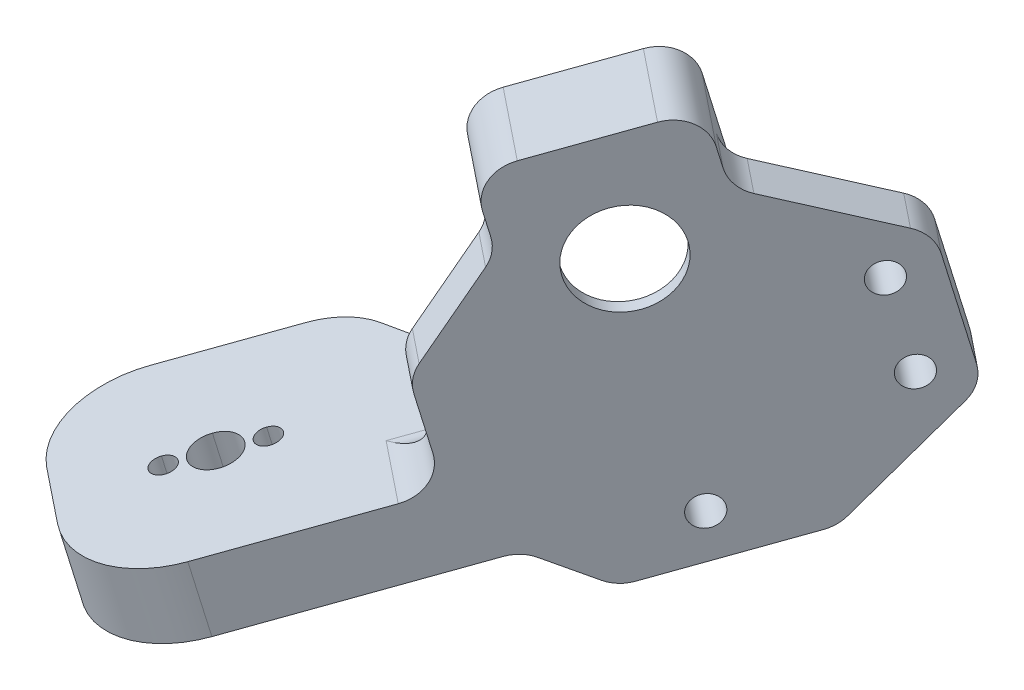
ISO-10303-21;
HEADER;
FILE_DESCRIPTION(('STEP AP214'),'2;1');
FILE_NAME('part.step','',(''),(''),'','','');
FILE_SCHEMA(('AUTOMOTIVE_DESIGN { 1 0 10303 214 1 1 1 1 }'));
ENDSEC;
DATA;
#1=APPLICATION_CONTEXT('core data for automotive mechanical design processes');
#2=APPLICATION_PROTOCOL_DEFINITION('international standard','automotive_design',2000,#1);
#3=PRODUCT_CONTEXT('',#1,'mechanical');
#4=PRODUCT('Part','Part','',(#3));
#5=PRODUCT_RELATED_PRODUCT_CATEGORY('part','',(#4));
#6=PRODUCT_DEFINITION_FORMATION('','',#4);
#7=PRODUCT_DEFINITION_CONTEXT('part definition',#1,'design');
#8=PRODUCT_DEFINITION('design','',#6,#7);
#9=PRODUCT_DEFINITION_SHAPE('','',#8);
#10=(LENGTH_UNIT() NAMED_UNIT(*) SI_UNIT(.MILLI.,.METRE.));
#11=(NAMED_UNIT(*) PLANE_ANGLE_UNIT() SI_UNIT($,.RADIAN.));
#12=(NAMED_UNIT(*) SI_UNIT($,.STERADIAN.) SOLID_ANGLE_UNIT());
#13=UNCERTAINTY_MEASURE_WITH_UNIT(LENGTH_MEASURE(1.E-05),#10,'distance_accuracy_value','');
#14=(GEOMETRIC_REPRESENTATION_CONTEXT(3) GLOBAL_UNCERTAINTY_ASSIGNED_CONTEXT((#13)) GLOBAL_UNIT_ASSIGNED_CONTEXT((#10,
#11,#12)) REPRESENTATION_CONTEXT('',''));
#15=CARTESIAN_POINT('',(0.,0.,0.));
#16=DIRECTION('',(0.,0.,1.));
#17=DIRECTION('',(1.,0.,0.));
#18=AXIS2_PLACEMENT_3D('',#15,#16,#17);
#19=CARTESIAN_POINT('',(150.041191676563,-75.6656199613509,229.745911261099));
#20=DIRECTION('',(-0.152393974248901,0.968392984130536,0.197461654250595));
#21=DIRECTION('',(0.781080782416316,-0.00440513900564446,0.624414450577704));
#22=AXIS2_PLACEMENT_3D('',#19,#20,#21);
#23=CYLINDRICAL_SURFACE('',#22,8.);
#24=CARTESIAN_POINT('',(150.041191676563,-75.6656199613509,229.745911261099));
#25=DIRECTION('',(-0.152393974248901,0.968392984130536,0.197461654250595));
#26=DIRECTION('',(0.781080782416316,-0.00440513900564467,0.624414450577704));
#27=AXIS2_PLACEMENT_3D('',#24,#25,#26);
#28=CIRCLE('',#27,8.);
#29=CARTESIAN_POINT('',(149.652759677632,-74.1278742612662,221.904708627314));
#30=VERTEX_POINT('',#29);
#31=CARTESIAN_POINT('',(143.792545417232,-75.6303788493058,224.750595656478));
#32=VERTEX_POINT('',#31);
#33=EDGE_CURVE('E944',#30,#32,#28,.T.);
#34=ORIENTED_EDGE('',*,*,#33,.F.);
#35=DIRECTION('',(-0.152393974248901,0.968392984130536,0.197461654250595));
#36=VECTOR('',#35,1.);
#37=CARTESIAN_POINT('',(149.652759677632,-74.1278742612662,221.904708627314));
#38=LINE('',#37,#36);
#39=CARTESIAN_POINT('',(150.871911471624,-81.8750181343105,220.325015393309));
#40=VERTEX_POINT('',#39);
#41=EDGE_CURVE('E10',#40,#30,#38,.T.);
#42=ORIENTED_EDGE('',*,*,#41,.F.);
#43=CARTESIAN_POINT('',(151.260343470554,-83.4127638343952,228.166218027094));
#44=DIRECTION('',(0.152393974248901,-0.968392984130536,-0.197461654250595));
#45=DIRECTION('',(0.781080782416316,-0.00440513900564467,0.624414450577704));
#46=AXIS2_PLACEMENT_3D('',#43,#44,#45);
#47=CIRCLE('',#46,8.);
#48=CARTESIAN_POINT('',(145.011697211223,-83.37752272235,223.170902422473));
#49=VERTEX_POINT('',#48);
#50=EDGE_CURVE('E901',#49,#40,#47,.T.);
#51=ORIENTED_EDGE('',*,*,#50,.F.);
#52=DIRECTION('',(0.152393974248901,-0.968392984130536,-0.197461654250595));
#53=VECTOR('',#52,1.);
#54=CARTESIAN_POINT('',(145.011697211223,-83.37752272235,223.170902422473));
#55=LINE('',#54,#53);
#56=EDGE_CURVE('E716',#32,#49,#55,.T.);
#57=ORIENTED_EDGE('',*,*,#56,.F.);
#58=EDGE_LOOP('',(#34,#42,#51,#57));
#59=FACE_BOUND('',#58,.T.);
#60=ADVANCED_FACE('F17',(#59),#23,.T.);
#61=CARTESIAN_POINT('',(141.387719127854,-45.2726365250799,227.972964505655));
#62=DIRECTION('',(0.0485539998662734,-0.192218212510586,0.980150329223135));
#63=DIRECTION('',(0.152393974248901,-0.968392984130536,-0.197461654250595));
#64=AXIS2_PLACEMENT_3D('',#61,#62,#63);
#65=PLANE('',#64);
#66=DIRECTION('',(-0.987126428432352,-0.15895655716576,0.0177264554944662));
#67=VECTOR('',#66,1.);
#68=CARTESIAN_POINT('',(147.239800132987,-82.4598955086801,220.390239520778));
#69=LINE('',#68,#67);
#70=CARTESIAN_POINT('',(169.991940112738,-78.7961278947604,219.981664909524));
#71=VERTEX_POINT('',#70);
#72=EDGE_CURVE('E905',#71,#40,#69,.T.);
#73=ORIENTED_EDGE('',*,*,#72,.T.);
#74=ORIENTED_EDGE('',*,*,#41,.T.);
#75=DIRECTION('',(-0.987126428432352,-0.15895655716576,0.0177264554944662));
#76=VECTOR('',#75,1.);
#77=CARTESIAN_POINT('',(146.020648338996,-74.7127516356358,221.969932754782));
#78=LINE('',#77,#76);
#79=CARTESIAN_POINT('',(162.705550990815,-72.0259887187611,221.670311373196));
#80=VERTEX_POINT('',#79);
#81=EDGE_CURVE('E395',#80,#30,#78,.T.);
#82=ORIENTED_EDGE('',*,*,#81,.F.);
#83=CARTESIAN_POINT('',(162.705550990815,-72.0259887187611,221.670311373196));
#84=CARTESIAN_POINT('',(166.259656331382,-71.4536726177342,221.606488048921));
#85=CARTESIAN_POINT('',(168.520293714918,-69.4444979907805,221.888523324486));
#86=CARTESIAN_POINT('',(168.163212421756,-67.1754120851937,222.351204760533));
#87=(BOUNDED_CURVE() B_SPLINE_CURVE(3,(#83,#84,#85,#86),.UNSPECIFIED.,.F.,
.F.) B_SPLINE_CURVE_WITH_KNOTS((4,4),(1.5707963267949,3.1415926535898),
.UNSPECIFIED.) CURVE() GEOMETRIC_REPRESENTATION_ITEM() RATIONAL_B_SPLINE_CURVE((1.,
0.804737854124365,0.804737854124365,1.)) REPRESENTATION_ITEM(''));
#88=CARTESIAN_POINT('',(168.163212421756,-67.1754120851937,222.351204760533));
#89=VERTEX_POINT('',#88);
#90=EDGE_CURVE('E27',#80,#89,#87,.T.);
#91=ORIENTED_EDGE('',*,*,#90,.T.);
#92=DIRECTION('',(-0.152393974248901,0.968392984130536,0.197461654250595));
#93=VECTOR('',#92,1.);
#94=CARTESIAN_POINT('',(170.906303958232,-84.6064857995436,218.79689498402));
#95=LINE('',#94,#93);
#96=EDGE_CURVE('E392',#71,#89,#95,.T.);
#97=ORIENTED_EDGE('',*,*,#96,.F.);
#98=EDGE_LOOP('',(#73,#74,#82,#91,#97));
#99=FACE_BOUND('',#98,.T.);
#100=ADVANCED_FACE('F391',(#99),#65,.F.);
#101=CARTESIAN_POINT('',(167.171781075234,-44.4858472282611,223.75145848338));
#102=DIRECTION('',(-0.781080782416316,0.00440513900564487,-0.624414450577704));
#103=DIRECTION('',(-0.60554841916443,-0.249390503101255,0.755721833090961));
#104=AXIS2_PLACEMENT_3D('',#101,#102,#103);
#105=CYLINDRICAL_SURFACE('',#104,4.);
#106=CARTESIAN_POINT('',(167.171781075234,-44.4858472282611,223.75145848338));
#107=DIRECTION('',(-0.781080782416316,0.00440513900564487,-0.624414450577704));
#108=DIRECTION('',(-0.60554841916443,-0.249390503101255,0.755721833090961));
#109=AXIS2_PLACEMENT_3D('',#106,#107,#108);
#110=CIRCLE('',#109,4.);
#111=CARTESIAN_POINT('',(164.749587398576,-45.4834092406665,226.774345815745));
#112=VERTEX_POINT('',#111);
#113=CARTESIAN_POINT('',(166.562205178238,-40.612275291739,224.541305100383));
#114=VERTEX_POINT('',#113);
#115=EDGE_CURVE('E411',#112,#114,#110,.T.);
#116=ORIENTED_EDGE('',*,*,#115,.F.);
#117=DIRECTION('',(-0.781080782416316,0.00440513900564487,-0.624414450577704));
#118=VECTOR('',#117,1.);
#119=CARTESIAN_POINT('',(164.749587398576,-45.4834092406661,226.774345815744));
#120=LINE('',#119,#118);
#121=CARTESIAN_POINT('',(172.950935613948,-45.5296632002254,233.33069754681));
#122=VERTEX_POINT('',#121);
#123=EDGE_CURVE('E428',#122,#112,#120,.T.);
#124=ORIENTED_EDGE('',*,*,#123,.F.);
#125=CARTESIAN_POINT('',(175.373129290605,-44.5321011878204,230.307810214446));
#126=DIRECTION('',(0.781080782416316,-0.00440513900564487,0.624414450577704));
#127=DIRECTION('',(0.60554841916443,0.249390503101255,-0.755721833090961));
#128=AXIS2_PLACEMENT_3D('',#125,#126,#127);
#129=CIRCLE('',#128,4.);
#130=CARTESIAN_POINT('',(174.76355339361,-40.6585292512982,231.097656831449));
#131=VERTEX_POINT('',#130);
#132=EDGE_CURVE('E634',#131,#122,#129,.T.);
#133=ORIENTED_EDGE('',*,*,#132,.F.);
#134=DIRECTION('',(0.781080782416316,-0.00440513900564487,0.624414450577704));
#135=VECTOR('',#134,1.);
#136=CARTESIAN_POINT('',(174.76355339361,-40.6585292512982,231.097656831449));
#137=LINE('',#136,#135);
#138=EDGE_CURVE('E864',#114,#131,#137,.T.);
#139=ORIENTED_EDGE('',*,*,#138,.F.);
#140=EDGE_LOOP('',(#116,#124,#133,#139));
#141=FACE_BOUND('',#140,.T.);
#142=ADVANCED_FACE('F19',(#141),#105,.T.);
#143=CARTESIAN_POINT('',(182.639710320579,-41.5394151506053,221.239148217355));
#144=DIRECTION('',(0.781080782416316,-0.00440513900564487,0.624414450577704));
#145=DIRECTION('',(0.60554841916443,0.249390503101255,-0.755721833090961));
#146=AXIS2_PLACEMENT_3D('',#143,#144,#145);
#147=CYLINDRICAL_SURFACE('',#146,4.);
#148=CARTESIAN_POINT('',(174.438362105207,-41.493161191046,214.682796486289));
#149=DIRECTION('',(-0.781080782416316,0.00440513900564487,-0.624414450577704));
#150=DIRECTION('',(-0.60554841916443,-0.249390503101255,0.755721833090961));
#151=AXIS2_PLACEMENT_3D('',#148,#149,#150);
#152=CIRCLE('',#151,4.);
#153=CARTESIAN_POINT('',(173.828786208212,-37.6195892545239,215.472643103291));
#154=VERTEX_POINT('',#153);
#155=CARTESIAN_POINT('',(176.860555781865,-40.495599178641,211.659909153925));
#156=VERTEX_POINT('',#155);
#157=EDGE_CURVE('E886',#154,#156,#152,.T.);
#158=ORIENTED_EDGE('',*,*,#157,.F.);
#159=DIRECTION('',(-0.781080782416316,0.00440513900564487,-0.624414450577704));
#160=VECTOR('',#159,1.);
#161=CARTESIAN_POINT('',(173.828786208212,-37.6195892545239,215.472643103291));
#162=LINE('',#161,#160);
#163=CARTESIAN_POINT('',(182.030134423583,-37.6658432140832,222.028994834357));
#164=VERTEX_POINT('',#163);
#165=EDGE_CURVE('E675',#164,#154,#162,.T.);
#166=ORIENTED_EDGE('',*,*,#165,.F.);
#167=CARTESIAN_POINT('',(182.639710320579,-41.5394151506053,221.239148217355));
#168=DIRECTION('',(0.781080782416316,-0.00440513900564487,0.624414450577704));
#169=DIRECTION('',(0.60554841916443,0.249390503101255,-0.755721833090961));
#170=AXIS2_PLACEMENT_3D('',#167,#168,#169);
#171=CIRCLE('',#170,4.);
#172=CARTESIAN_POINT('',(185.061903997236,-40.5418531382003,218.216260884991));
#173=VERTEX_POINT('',#172);
#174=EDGE_CURVE('E663',#173,#164,#171,.T.);
#175=ORIENTED_EDGE('',*,*,#174,.F.);
#176=DIRECTION('',(0.781080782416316,-0.00440513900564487,0.624414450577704));
#177=VECTOR('',#176,1.);
#178=CARTESIAN_POINT('',(185.061903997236,-40.5418531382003,218.216260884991));
#179=LINE('',#178,#177);
#180=EDGE_CURVE('E452',#156,#173,#179,.T.);
#181=ORIENTED_EDGE('',*,*,#180,.F.);
#182=EDGE_LOOP('',(#158,#166,#175,#181));
#183=FACE_BOUND('',#182,.T.);
#184=ADVANCED_FACE('F1076',(#183),#147,.T.);
#185=CARTESIAN_POINT('',(170.946780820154,-49.183668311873,235.811918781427));
#186=DIRECTION('',(0.781080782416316,-0.00440513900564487,0.624414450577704));
#187=DIRECTION('',(0.60554841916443,0.249390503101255,-0.755721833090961));
#188=AXIS2_PLACEMENT_3D('',#185,#186,#187);
#189=CYLINDRICAL_SURFACE('',#188,4.);
#190=CARTESIAN_POINT('',(170.946780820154,-49.183668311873,235.811918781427));
#191=DIRECTION('',(-0.781080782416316,0.00440513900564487,-0.624414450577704));
#192=DIRECTION('',(0.60554841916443,0.249390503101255,-0.755721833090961));
#193=AXIS2_PLACEMENT_3D('',#190,#191,#192);
#194=CIRCLE('',#193,4.);
#195=CARTESIAN_POINT('',(173.368974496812,-48.186106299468,232.789031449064));
#196=VERTEX_POINT('',#195);
#197=CARTESIAN_POINT('',(173.09056564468,-51.217314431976,233.11590875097));
#198=VERTEX_POINT('',#197);
#199=EDGE_CURVE('E637',#196,#198,#194,.T.);
#200=ORIENTED_EDGE('',*,*,#199,.F.);
#201=DIRECTION('',(0.781080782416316,-0.00440513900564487,0.624414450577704));
#202=VECTOR('',#201,1.);
#203=CARTESIAN_POINT('',(173.368974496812,-48.186106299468,232.789031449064));
#204=LINE('',#203,#202);
#205=CARTESIAN_POINT('',(169.46357058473,-48.1640806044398,229.666959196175));
#206=VERTEX_POINT('',#205);
#207=EDGE_CURVE('E422',#206,#196,#204,.T.);
#208=ORIENTED_EDGE('',*,*,#207,.F.);
#209=CARTESIAN_POINT('',(167.041376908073,-49.1616426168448,232.689846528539));
#210=DIRECTION('',(0.781080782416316,-0.00440513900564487,0.624414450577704));
#211=DIRECTION('',(0.60554841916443,0.249390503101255,-0.755721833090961));
#212=AXIS2_PLACEMENT_3D('',#209,#210,#211);
#213=CIRCLE('',#212,4.);
#214=CARTESIAN_POINT('',(169.185161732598,-51.1952887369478,229.993836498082));
#215=VERTEX_POINT('',#214);
#216=EDGE_CURVE('E577',#215,#206,#213,.T.);
#217=ORIENTED_EDGE('',*,*,#216,.F.);
#218=DIRECTION('',(-0.781080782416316,0.00440513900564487,-0.624414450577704));
#219=VECTOR('',#218,1.);
#220=CARTESIAN_POINT('',(169.185161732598,-51.1952887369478,229.993836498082));
#221=LINE('',#220,#219);
#222=EDGE_CURVE('E469',#198,#215,#221,.T.);
#223=ORIENTED_EDGE('',*,*,#222,.F.);
#224=EDGE_LOOP('',(#200,#208,#217,#223));
#225=FACE_BOUND('',#224,.T.);
#226=ADVANCED_FACE('F1337',(#225),#189,.F.);
#227=CARTESIAN_POINT('',(171.764612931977,-62.5753512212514,234.69441554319));
#228=DIRECTION('',(-0.781080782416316,0.00440513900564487,-0.624414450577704));
#229=DIRECTION('',(-0.60554841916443,-0.249390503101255,0.755721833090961));
#230=AXIS2_PLACEMENT_3D('',#227,#228,#229);
#231=CYLINDRICAL_SURFACE('',#230,4.);
#232=CARTESIAN_POINT('',(171.764612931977,-62.5753512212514,234.69441554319));
#233=DIRECTION('',(0.781080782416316,-0.00440513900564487,0.624414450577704));
#234=DIRECTION('',(0.60554841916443,0.249390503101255,-0.755721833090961));
#235=AXIS2_PLACEMENT_3D('',#232,#233,#234);
#236=CIRCLE('',#235,4.);
#237=CARTESIAN_POINT('',(169.620828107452,-60.5417051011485,237.390425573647));
#238=VERTEX_POINT('',#237);
#239=CARTESIAN_POINT('',(169.342419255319,-63.5729132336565,237.717302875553));
#240=VERTEX_POINT('',#239);
#241=EDGE_CURVE('E568',#238,#240,#236,.T.);
#242=ORIENTED_EDGE('',*,*,#241,.F.);
#243=DIRECTION('',(0.781080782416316,-0.00440513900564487,0.624414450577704));
#244=VECTOR('',#243,1.);
#245=CARTESIAN_POINT('',(169.620828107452,-60.5417051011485,237.390425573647));
#246=LINE('',#245,#244);
#247=CARTESIAN_POINT('',(165.71542419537,-60.5196794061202,234.268353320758));
#248=VERTEX_POINT('',#247);
#249=EDGE_CURVE('E778',#248,#238,#246,.T.);
#250=ORIENTED_EDGE('',*,*,#249,.F.);
#251=CARTESIAN_POINT('',(167.859209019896,-62.5533255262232,231.572343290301));
#252=DIRECTION('',(-0.781080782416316,0.00440513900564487,-0.624414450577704));
#253=DIRECTION('',(0.60554841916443,0.249390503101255,-0.755721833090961));
#254=AXIS2_PLACEMENT_3D('',#251,#252,#253);
#255=CIRCLE('',#254,4.);
#256=CARTESIAN_POINT('',(165.437015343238,-63.5508875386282,234.595230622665));
#257=VERTEX_POINT('',#256);
#258=EDGE_CURVE('E578',#257,#248,#255,.T.);
#259=ORIENTED_EDGE('',*,*,#258,.F.);
#260=DIRECTION('',(-0.781080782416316,0.00440513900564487,-0.624414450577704));
#261=VECTOR('',#260,1.);
#262=CARTESIAN_POINT('',(169.342419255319,-63.5729132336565,237.717302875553));
#263=LINE('',#262,#261);
#264=EDGE_CURVE('E587',#240,#257,#263,.T.);
#265=ORIENTED_EDGE('',*,*,#264,.F.);
#266=EDGE_LOOP('',(#242,#250,#259,#265));
#267=FACE_BOUND('',#266,.T.);
#268=ADVANCED_FACE('F1347',(#267),#231,.T.);
#269=CARTESIAN_POINT('',(174.530279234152,-84.4755853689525,231.080337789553));
#270=DIRECTION('',(-0.781080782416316,0.00440513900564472,-0.624414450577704));
#271=DIRECTION('',(-0.60554841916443,-0.249390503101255,0.755721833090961));
#272=AXIS2_PLACEMENT_3D('',#269,#270,#271);
#273=CYLINDRICAL_SURFACE('',#272,4.);
#274=CARTESIAN_POINT('',(174.530279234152,-84.4755853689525,231.080337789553));
#275=DIRECTION('',(-0.781080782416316,0.00440513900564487,-0.624414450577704));
#276=DIRECTION('',(0.60554841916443,0.249390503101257,-0.755721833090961));
#277=AXIS2_PLACEMENT_3D('',#274,#275,#276);
#278=CIRCLE('',#277,4.);
#279=CARTESIAN_POINT('',(173.920703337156,-80.6020134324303,231.870184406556));
#280=VERTEX_POINT('',#279);
#281=CARTESIAN_POINT('',(175.690723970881,-80.9233539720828,229.653796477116));
#282=VERTEX_POINT('',#281);
#283=EDGE_CURVE('E751',#280,#282,#278,.T.);
#284=ORIENTED_EDGE('',*,*,#283,.F.);
#285=DIRECTION('',(0.781080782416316,-0.00440513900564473,0.624414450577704));
#286=VECTOR('',#285,1.);
#287=CARTESIAN_POINT('',(173.920703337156,-80.6020134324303,231.870184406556));
#288=LINE('',#287,#286);
#289=CARTESIAN_POINT('',(170.015299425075,-80.5799877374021,228.748112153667));
#290=VERTEX_POINT('',#289);
#291=EDGE_CURVE('E912',#290,#280,#288,.T.);
#292=ORIENTED_EDGE('',*,*,#291,.F.);
#293=CARTESIAN_POINT('',(170.62487532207,-84.4535596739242,227.958265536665));
#294=DIRECTION('',(0.781080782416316,-0.00440513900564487,0.624414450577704));
#295=DIRECTION('',(0.60554841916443,0.249390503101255,-0.755721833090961));
#296=AXIS2_PLACEMENT_3D('',#293,#294,#295);
#297=CIRCLE('',#296,4.);
#298=CARTESIAN_POINT('',(171.7853200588,-80.9013282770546,226.531724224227));
#299=VERTEX_POINT('',#298);
#300=EDGE_CURVE('E724',#299,#290,#297,.T.);
#301=ORIENTED_EDGE('',*,*,#300,.F.);
#302=DIRECTION('',(-0.781080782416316,0.00440513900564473,-0.624414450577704));
#303=VECTOR('',#302,1.);
#304=CARTESIAN_POINT('',(175.690723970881,-80.9233539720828,229.653796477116));
#305=LINE('',#304,#303);
#306=EDGE_CURVE('E490',#282,#299,#305,.T.);
#307=ORIENTED_EDGE('',*,*,#306,.F.);
#308=EDGE_LOOP('',(#284,#292,#301,#307));
#309=FACE_BOUND('',#308,.T.);
#310=ADVANCED_FACE('F1364',(#309),#273,.F.);
#311=CARTESIAN_POINT('',(180.138024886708,-80.1037674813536,224.096444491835));
#312=DIRECTION('',(-0.781080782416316,0.00440513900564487,-0.624414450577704));
#313=DIRECTION('',(-0.60554841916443,-0.249390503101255,0.755721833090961));
#314=AXIS2_PLACEMENT_3D('',#311,#312,#313);
#315=CYLINDRICAL_SURFACE('',#314,4.);
#316=CARTESIAN_POINT('',(180.138024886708,-80.1037674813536,224.096444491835));
#317=DIRECTION('',(0.781080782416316,-0.00440513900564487,0.624414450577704));
#318=DIRECTION('',(0.60554841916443,0.249390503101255,-0.755721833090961));
#319=AXIS2_PLACEMENT_3D('',#316,#317,#318);
#320=CIRCLE('',#319,4.);
#321=CARTESIAN_POINT('',(178.977580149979,-83.6559988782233,225.522985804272));
#322=VERTEX_POINT('',#321);
#323=CARTESIAN_POINT('',(180.747600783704,-83.9773394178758,223.306597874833));
#324=VERTEX_POINT('',#323);
#325=EDGE_CURVE('E754',#322,#324,#320,.T.);
#326=ORIENTED_EDGE('',*,*,#325,.F.);
#327=DIRECTION('',(0.781080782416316,-0.00440513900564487,0.624414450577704));
#328=VECTOR('',#327,1.);
#329=CARTESIAN_POINT('',(178.977580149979,-83.6559988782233,225.522985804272));
#330=LINE('',#329,#328);
#331=CARTESIAN_POINT('',(175.072176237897,-83.6339731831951,222.400913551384));
#332=VERTEX_POINT('',#331);
#333=EDGE_CURVE('E514',#332,#322,#330,.T.);
#334=ORIENTED_EDGE('',*,*,#333,.F.);
#335=CARTESIAN_POINT('',(176.232620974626,-80.0817417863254,220.974372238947));
#336=DIRECTION('',(-0.781080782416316,0.00440513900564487,-0.624414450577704));
#337=DIRECTION('',(0.60554841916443,0.249390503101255,-0.755721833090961));
#338=AXIS2_PLACEMENT_3D('',#335,#336,#337);
#339=CIRCLE('',#338,4.);
#340=CARTESIAN_POINT('',(176.842196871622,-83.9553137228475,220.184525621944));
#341=VERTEX_POINT('',#340);
#342=EDGE_CURVE('E709',#341,#332,#339,.T.);
#343=ORIENTED_EDGE('',*,*,#342,.F.);
#344=DIRECTION('',(-0.781080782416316,0.00440513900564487,-0.624414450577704));
#345=VECTOR('',#344,1.);
#346=CARTESIAN_POINT('',(180.747600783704,-83.9773394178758,223.306597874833));
#347=LINE('',#346,#345);
#348=EDGE_CURVE('E772',#324,#341,#347,.T.);
#349=ORIENTED_EDGE('',*,*,#348,.F.);
#350=EDGE_LOOP('',(#326,#334,#343,#349));
#351=FACE_BOUND('',#350,.T.);
#352=ADVANCED_FACE('F1372',(#351),#315,.T.);
#353=CARTESIAN_POINT('',(189.875663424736,-76.0933952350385,211.943913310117));
#354=DIRECTION('',(0.781080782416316,-0.00440513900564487,0.624414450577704));
#355=DIRECTION('',(0.60554841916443,0.249390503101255,-0.755721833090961));
#356=AXIS2_PLACEMENT_3D('',#353,#354,#355);
#357=CYLINDRICAL_SURFACE('',#356,4.);
#358=CARTESIAN_POINT('',(189.875663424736,-76.0933952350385,211.943913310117));
#359=DIRECTION('',(0.781080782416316,-0.00440513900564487,0.624414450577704));
#360=DIRECTION('',(0.60554841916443,0.249390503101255,-0.755721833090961));
#361=AXIS2_PLACEMENT_3D('',#358,#359,#360);
#362=CIRCLE('',#361,4.);
#363=CARTESIAN_POINT('',(190.485239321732,-79.9669671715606,211.154066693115));
#364=VERTEX_POINT('',#363);
#365=CARTESIAN_POINT('',(191.72645253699,-78.7630540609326,209.609925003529));
#366=VERTEX_POINT('',#365);
#367=EDGE_CURVE('E838',#364,#366,#362,.T.);
#368=ORIENTED_EDGE('',*,*,#367,.F.);
#369=DIRECTION('',(0.781080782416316,-0.00440513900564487,0.624414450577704));
#370=VECTOR('',#369,1.);
#371=CARTESIAN_POINT('',(190.485239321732,-79.9669671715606,211.154066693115));
#372=LINE('',#371,#370);
#373=CARTESIAN_POINT('',(186.57983540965,-79.9449414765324,208.031994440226));
#374=VERTEX_POINT('',#373);
#375=EDGE_CURVE('E642',#374,#364,#372,.T.);
#376=ORIENTED_EDGE('',*,*,#375,.F.);
#377=CARTESIAN_POINT('',(185.970259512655,-76.0713695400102,208.821841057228));
#378=DIRECTION('',(-0.781080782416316,0.00440513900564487,-0.624414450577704));
#379=DIRECTION('',(0.60554841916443,0.249390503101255,-0.755721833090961));
#380=AXIS2_PLACEMENT_3D('',#377,#378,#379);
#381=CIRCLE('',#380,4.);
#382=CARTESIAN_POINT('',(187.821048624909,-78.7410283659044,206.487852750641));
#383=VERTEX_POINT('',#382);
#384=EDGE_CURVE('E701',#383,#374,#381,.T.);
#385=ORIENTED_EDGE('',*,*,#384,.F.);
#386=DIRECTION('',(-0.781080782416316,0.00440513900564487,-0.624414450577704));
#387=VECTOR('',#386,1.);
#388=CARTESIAN_POINT('',(187.821048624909,-78.7410283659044,206.487852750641));
#389=LINE('',#388,#387);
#390=EDGE_CURVE('E746',#366,#383,#389,.T.);
#391=ORIENTED_EDGE('',*,*,#390,.F.);
#392=EDGE_LOOP('',(#368,#376,#385,#391));
#393=FACE_BOUND('',#392,.T.);
#394=ADVANCED_FACE('F1378',(#393),#357,.T.);
#395=CARTESIAN_POINT('',(196.029478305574,-65.1646315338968,204.323199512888));
#396=DIRECTION('',(-0.781080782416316,0.00440513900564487,-0.624414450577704));
#397=DIRECTION('',(-0.60554841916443,-0.249390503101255,0.755721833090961));
#398=AXIS2_PLACEMENT_3D('',#395,#396,#397);
#399=CYLINDRICAL_SURFACE('',#398,4.);
#400=CARTESIAN_POINT('',(196.029478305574,-65.1646315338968,204.323199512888));
#401=DIRECTION('',(0.781080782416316,-0.00440513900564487,0.624414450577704));
#402=DIRECTION('',(0.60554841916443,0.249390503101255,-0.755721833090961));
#403=AXIS2_PLACEMENT_3D('',#400,#401,#402);
#404=CIRCLE('',#403,4.);
#405=CARTESIAN_POINT('',(197.880267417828,-67.8342903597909,201.9892112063));
#406=VERTEX_POINT('',#405);
#407=CARTESIAN_POINT('',(198.451671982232,-64.1670695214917,201.300312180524));
#408=VERTEX_POINT('',#407);
#409=EDGE_CURVE('E841',#406,#408,#404,.T.);
#410=ORIENTED_EDGE('',*,*,#409,.F.);
#411=DIRECTION('',(0.781080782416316,-0.00440513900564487,0.624414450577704));
#412=VECTOR('',#411,1.);
#413=CARTESIAN_POINT('',(197.880267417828,-67.8342903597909,201.9892112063));
#414=LINE('',#413,#412);
#415=CARTESIAN_POINT('',(193.974863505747,-67.8122646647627,198.867138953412));
#416=VERTEX_POINT('',#415);
#417=EDGE_CURVE('E439',#416,#406,#414,.T.);
#418=ORIENTED_EDGE('',*,*,#417,.F.);
#419=CARTESIAN_POINT('',(192.124074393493,-65.1426058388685,201.201127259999));
#420=DIRECTION('',(-0.781080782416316,0.00440513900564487,-0.624414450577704));
#421=DIRECTION('',(0.60554841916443,0.249390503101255,-0.755721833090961));
#422=AXIS2_PLACEMENT_3D('',#419,#420,#421);
#423=CIRCLE('',#422,4.);
#424=CARTESIAN_POINT('',(194.54626807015,-64.1450438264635,198.178239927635));
#425=VERTEX_POINT('',#424);
#426=EDGE_CURVE('E683',#425,#416,#423,.T.);
#427=ORIENTED_EDGE('',*,*,#426,.F.);
#428=DIRECTION('',(-0.781080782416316,0.00440513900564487,-0.624414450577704));
#429=VECTOR('',#428,1.);
#430=CARTESIAN_POINT('',(198.451671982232,-64.1670695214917,201.300312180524));
#431=LINE('',#430,#429);
#432=EDGE_CURVE('E541',#408,#425,#431,.T.);
#433=ORIENTED_EDGE('',*,*,#432,.F.);
#434=EDGE_LOOP('',(#410,#418,#427,#433));
#435=FACE_BOUND('',#434,.T.);
#436=ADVANCED_FACE('F2424',(#435),#399,.T.);
#437=CARTESIAN_POINT('',(194.243644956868,-53.8164893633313,206.637159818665));
#438=DIRECTION('',(-0.781080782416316,0.00440513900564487,-0.624414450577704));
#439=DIRECTION('',(-0.60554841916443,-0.249390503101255,0.755721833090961));
#440=AXIS2_PLACEMENT_3D('',#437,#438,#439);
#441=CYLINDRICAL_SURFACE('',#440,4.);
#442=CARTESIAN_POINT('',(194.243644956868,-53.8164893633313,206.637159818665));
#443=DIRECTION('',(0.781080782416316,-0.00440513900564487,0.624414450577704));
#444=DIRECTION('',(0.60554841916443,0.249390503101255,-0.755721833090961));
#445=AXIS2_PLACEMENT_3D('',#442,#443,#444);
#446=CIRCLE('',#445,4.);
#447=CARTESIAN_POINT('',(196.665838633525,-52.8189273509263,203.614272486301));
#448=VERTEX_POINT('',#447);
#449=CARTESIAN_POINT('',(195.080038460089,-50.0401348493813,205.617555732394));
#450=VERTEX_POINT('',#449);
#451=EDGE_CURVE('E809',#448,#450,#446,.T.);
#452=ORIENTED_EDGE('',*,*,#451,.F.);
#453=DIRECTION('',(0.781080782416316,-0.00440513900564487,0.624414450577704));
#454=VECTOR('',#453,1.);
#455=CARTESIAN_POINT('',(196.665838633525,-52.8189273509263,203.614272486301));
#456=LINE('',#455,#454);
#457=CARTESIAN_POINT('',(192.760434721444,-52.7969016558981,200.492200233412));
#458=VERTEX_POINT('',#457);
#459=EDGE_CURVE('E798',#458,#448,#456,.T.);
#460=ORIENTED_EDGE('',*,*,#459,.F.);
#461=CARTESIAN_POINT('',(190.338241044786,-53.7944636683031,203.515087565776));
#462=DIRECTION('',(-0.781080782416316,0.00440513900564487,-0.624414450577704));
#463=DIRECTION('',(0.60554841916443,0.249390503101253,-0.755721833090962));
#464=AXIS2_PLACEMENT_3D('',#461,#462,#463);
#465=CIRCLE('',#464,4.);
#466=CARTESIAN_POINT('',(191.174634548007,-50.0181091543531,202.495483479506));
#467=VERTEX_POINT('',#466);
#468=EDGE_CURVE('E671',#467,#458,#465,.T.);
#469=ORIENTED_EDGE('',*,*,#468,.F.);
#470=DIRECTION('',(-0.781080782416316,0.00440513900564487,-0.624414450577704));
#471=VECTOR('',#470,1.);
#472=CARTESIAN_POINT('',(195.080038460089,-50.0401348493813,205.617555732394));
#473=LINE('',#472,#471);
#474=EDGE_CURVE('E551',#450,#467,#473,.T.);
#475=ORIENTED_EDGE('',*,*,#474,.F.);
#476=EDGE_LOOP('',(#452,#460,#469,#475));
#477=FACE_BOUND('',#476,.T.);
#478=ADVANCED_FACE('F2416',(#477),#441,.T.);
#479=CARTESIAN_POINT('',(187.828396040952,-41.7321474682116,214.74725535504));
#480=DIRECTION('',(0.781080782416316,-0.00440513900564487,0.624414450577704));
#481=DIRECTION('',(0.60554841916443,0.249390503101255,-0.755721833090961));
#482=AXIS2_PLACEMENT_3D('',#479,#480,#481);
#483=CYLINDRICAL_SURFACE('',#482,4.);
#484=CARTESIAN_POINT('',(187.828396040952,-41.7321474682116,214.74725535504));
#485=DIRECTION('',(-0.781080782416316,0.00440513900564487,-0.624414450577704));
#486=DIRECTION('',(0.60554841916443,0.249390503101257,-0.755721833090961));
#487=AXIS2_PLACEMENT_3D('',#484,#485,#486);
#488=CIRCLE('',#487,4.);
#489=CARTESIAN_POINT('',(186.992002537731,-45.5085019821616,215.76685944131));
#490=VERTEX_POINT('',#489);
#491=CARTESIAN_POINT('',(185.406202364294,-42.7297094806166,217.770142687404));
#492=VERTEX_POINT('',#491);
#493=EDGE_CURVE('E828',#490,#492,#488,.T.);
#494=ORIENTED_EDGE('',*,*,#493,.F.);
#495=DIRECTION('',(0.781080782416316,-0.00440513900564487,0.624414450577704));
#496=VECTOR('',#495,1.);
#497=CARTESIAN_POINT('',(186.992002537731,-45.5085019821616,215.76685944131));
#498=LINE('',#497,#496);
#499=CARTESIAN_POINT('',(183.086598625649,-45.4864762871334,212.644787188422));
#500=VERTEX_POINT('',#499);
#501=EDGE_CURVE('E544',#500,#490,#498,.T.);
#502=ORIENTED_EDGE('',*,*,#501,.F.);
#503=CARTESIAN_POINT('',(183.92299212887,-41.7101217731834,211.625183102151));
#504=DIRECTION('',(0.781080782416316,-0.00440513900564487,0.624414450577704));
#505=DIRECTION('',(0.60554841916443,0.249390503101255,-0.755721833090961));
#506=AXIS2_PLACEMENT_3D('',#503,#504,#505);
#507=CIRCLE('',#506,4.);
#508=CARTESIAN_POINT('',(181.500798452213,-42.7076837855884,214.648070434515));
#509=VERTEX_POINT('',#508);
#510=EDGE_CURVE('E499',#509,#500,#507,.T.);
#511=ORIENTED_EDGE('',*,*,#510,.F.);
#512=DIRECTION('',(-0.781080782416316,0.00440513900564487,-0.624414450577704));
#513=VECTOR('',#512,1.);
#514=CARTESIAN_POINT('',(181.500798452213,-42.7076837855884,214.648070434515));
#515=LINE('',#514,#513);
#516=EDGE_CURVE('E451',#492,#509,#515,.T.);
#517=ORIENTED_EDGE('',*,*,#516,.F.);
#518=EDGE_LOOP('',(#494,#502,#511,#517));
#519=FACE_BOUND('',#518,.T.);
#520=ADVANCED_FACE('F1295',(#519),#483,.F.);
#521=CARTESIAN_POINT('',(178.552999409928,-67.6397717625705,209.351331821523));
#522=DIRECTION('',(-0.781080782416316,0.00440513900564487,-0.624414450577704));
#523=DIRECTION('',(-0.60554841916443,-0.249390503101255,0.755721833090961));
#524=AXIS2_PLACEMENT_3D('',#521,#522,#523);
#525=CYLINDRICAL_SURFACE('',#524,4.);
#526=CARTESIAN_POINT('',(178.552999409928,-67.6397717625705,209.351331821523));
#527=DIRECTION('',(-0.781080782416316,0.00440513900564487,-0.624414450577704));
#528=DIRECTION('',(-0.60554841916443,-0.249390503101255,0.755721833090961));
#529=AXIS2_PLACEMENT_3D('',#526,#527,#528);
#530=CIRCLE('',#529,4.);
#531=CARTESIAN_POINT('',(180.975193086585,-66.6422097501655,206.328444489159));
#532=VERTEX_POINT('',#531);
#533=CARTESIAN_POINT('',(179.162575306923,-71.5133436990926,208.56148520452));
#534=VERTEX_POINT('',#533);
#535=EDGE_CURVE('E878',#532,#534,#530,.T.);
#536=ORIENTED_EDGE('',*,*,#535,.F.);
#537=DIRECTION('',(-0.781080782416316,0.00440513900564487,-0.624414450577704));
#538=VECTOR('',#537,1.);
#539=CARTESIAN_POINT('',(180.975193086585,-66.6422097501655,206.328444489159));
#540=LINE('',#539,#538);
#541=CARTESIAN_POINT('',(185.271137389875,-66.6664380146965,209.762723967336));
#542=VERTEX_POINT('',#541);
#543=EDGE_CURVE('E508',#542,#532,#540,.T.);
#544=ORIENTED_EDGE('',*,*,#543,.F.);
#545=CARTESIAN_POINT('',(182.848943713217,-67.6640000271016,212.7856112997));
#546=DIRECTION('',(0.781080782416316,-0.00440513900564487,0.624414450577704));
#547=DIRECTION('',(0.60554841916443,0.249390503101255,-0.755721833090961));
#548=AXIS2_PLACEMENT_3D('',#545,#546,#547);
#549=CIRCLE('',#548,4.);
#550=CARTESIAN_POINT('',(183.458519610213,-71.5375719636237,211.995764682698));
#551=VERTEX_POINT('',#550);
#552=EDGE_CURVE('E500',#551,#542,#549,.T.);
#553=ORIENTED_EDGE('',*,*,#552,.F.);
#554=DIRECTION('',(0.781080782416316,-0.00440513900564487,0.624414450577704));
#555=VECTOR('',#554,1.);
#556=CARTESIAN_POINT('',(183.458519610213,-71.5375719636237,211.995764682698));
#557=LINE('',#556,#555);
#558=EDGE_CURVE('E868',#534,#551,#557,.T.);
#559=ORIENTED_EDGE('',*,*,#558,.F.);
#560=EDGE_LOOP('',(#536,#544,#553,#559));
#561=FACE_BOUND('',#560,.T.);
#562=ADVANCED_FACE('F1310',(#561),#525,.T.);
#563=CARTESIAN_POINT('',(172.478165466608,-78.390888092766,216.874501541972));
#564=DIRECTION('',(0.781080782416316,-0.00440513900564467,0.624414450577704));
#565=DIRECTION('',(0.152393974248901,-0.968392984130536,-0.197461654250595));
#566=AXIS2_PLACEMENT_3D('',#563,#564,#565);
#567=CYLINDRICAL_SURFACE('',#566,4.);
#568=CARTESIAN_POINT('',(172.478165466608,-78.390888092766,216.874501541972));
#569=DIRECTION('',(0.781080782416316,-0.00440513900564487,0.624414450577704));
#570=DIRECTION('',(-0.60554841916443,-0.249390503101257,0.755721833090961));
#571=AXIS2_PLACEMENT_3D('',#568,#569,#570);
#572=CIRCLE('',#571,4.);
#573=CARTESIAN_POINT('',(171.868589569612,-74.5173161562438,217.664348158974));
#574=VERTEX_POINT('',#573);
#575=EDGE_CURVE('E409',#574,#71,#572,.T.);
#576=ORIENTED_EDGE('',*,*,#575,.F.);
#577=DIRECTION('',(-0.781080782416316,0.00440513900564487,-0.624414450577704));
#578=VECTOR('',#577,1.);
#579=CARTESIAN_POINT('',(171.868589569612,-74.5173161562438,217.664348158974));
#580=LINE('',#579,#578);
#581=CARTESIAN_POINT('',(176.164533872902,-74.5415444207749,221.098627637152));
#582=VERTEX_POINT('',#581);
#583=EDGE_CURVE('E859',#582,#574,#580,.T.);
#584=ORIENTED_EDGE('',*,*,#583,.F.);
#585=CARTESIAN_POINT('',(176.774109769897,-78.415116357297,220.308781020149));
#586=DIRECTION('',(-0.781080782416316,0.00440513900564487,-0.624414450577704));
#587=DIRECTION('',(0.60554841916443,0.249390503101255,-0.755721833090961));
#588=AXIS2_PLACEMENT_3D('',#585,#586,#587);
#589=CIRCLE('',#588,4.);
#590=CARTESIAN_POINT('',(174.287884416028,-78.8203561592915,223.415944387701));
#591=VERTEX_POINT('',#590);
#592=EDGE_CURVE('E592',#591,#582,#589,.T.);
#593=ORIENTED_EDGE('',*,*,#592,.F.);
#594=DIRECTION('',(0.781080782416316,-0.00440513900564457,0.624414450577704));
#595=VECTOR('',#594,1.);
#596=CARTESIAN_POINT('',(169.991940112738,-78.7961278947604,219.981664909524));
#597=LINE('',#596,#595);
#598=EDGE_CURVE('E908',#71,#591,#597,.T.);
#599=ORIENTED_EDGE('',*,*,#598,.F.);
#600=EDGE_LOOP('',(#576,#584,#593,#599));
#601=FACE_BOUND('',#600,.T.);
#602=ADVANCED_FACE('F1316',(#601),#567,.F.);
#603=CARTESIAN_POINT('',(173.942366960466,-68.2192280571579,231.93044382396));
#604=DIRECTION('',(-0.781080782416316,0.00440513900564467,-0.624414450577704));
#605=DIRECTION('',(-0.152393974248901,0.968392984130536,0.197461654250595));
#606=AXIS2_PLACEMENT_3D('',#603,#604,#605);
#607=CYLINDRICAL_SURFACE('',#606,4.);
#608=DIRECTION('',(0.781080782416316,-0.00440513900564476,0.624414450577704));
#609=VECTOR('',#608,1.);
#610=CARTESIAN_POINT('',(172.459156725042,-67.1996403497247,225.785484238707));
#611=LINE('',#610,#609);
#612=CARTESIAN_POINT('',(172.459156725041,-67.199640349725,225.785484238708));
#613=VERTEX_POINT('',#612);
#614=EDGE_CURVE('E414',#89,#613,#611,.T.);
#615=ORIENTED_EDGE('',*,*,#614,.F.);
#616=ORIENTED_EDGE('',*,*,#90,.F.);
#617=DIRECTION('',(-0.781080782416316,0.00440513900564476,-0.624414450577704));
#618=VECTOR('',#617,1.);
#619=CARTESIAN_POINT('',(166.35059464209,-72.0465460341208,224.584245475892));
#620=LINE('',#619,#618);
#621=CARTESIAN_POINT('',(167.522215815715,-72.0531537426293,225.520867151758));
#622=VERTEX_POINT('',#621);
#623=EDGE_CURVE('E971',#622,#80,#620,.T.);
#624=ORIENTED_EDGE('',*,*,#623,.F.);
#625=CARTESIAN_POINT('',(167.522215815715,-72.0531537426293,225.520867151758));
#626=CARTESIAN_POINT('',(170.771290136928,-71.4791173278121,225.213194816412));
#627=CARTESIAN_POINT('',(172.816238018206,-69.4687262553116,225.322802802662));
#628=CARTESIAN_POINT('',(172.459156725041,-67.199640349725,225.785484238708));
#629=(BOUNDED_CURVE() B_SPLINE_CURVE(3,(#625,#626,#627,#628),.UNSPECIFIED.,.F.,
.F.) B_SPLINE_CURVE_WITH_KNOTS((4,4),(1.5707963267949,3.1415926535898),
.UNSPECIFIED.) CURVE() GEOMETRIC_REPRESENTATION_ITEM() RATIONAL_B_SPLINE_CURVE((1.,
0.804737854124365,0.804737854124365,1.)) REPRESENTATION_ITEM(''));
#630=EDGE_CURVE('E366',#622,#613,#629,.T.);
#631=ORIENTED_EDGE('',*,*,#630,.T.);
#632=EDGE_LOOP('',(#615,#616,#624,#631));
#633=FACE_BOUND('',#632,.T.);
#634=ADVANCED_FACE('F415',(#633),#607,.F.);
#635=CARTESIAN_POINT('',(190.529028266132,-58.4533521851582,196.837562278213));
#636=DIRECTION('',(-0.60554841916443,-0.249390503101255,0.755721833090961));
#637=DIRECTION('',(0.152393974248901,-0.968392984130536,-0.197461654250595));
#638=AXIS2_PLACEMENT_3D('',#635,#636,#637);
#639=CYLINDRICAL_SURFACE('',#638,4.);
#640=CARTESIAN_POINT('',(161.46673162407,-74.5470587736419,233.078085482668));
#641=CARTESIAN_POINT('',(164.715805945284,-73.9730223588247,232.770413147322));
#642=CARTESIAN_POINT('',(166.760753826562,-71.9626312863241,232.880021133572));
#643=CARTESIAN_POINT('',(166.403672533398,-69.6935453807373,233.342702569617));
#644=(BOUNDED_CURVE() B_SPLINE_CURVE(3,(#640,#641,#642,#643),.UNSPECIFIED.,.F.,
.F.) B_SPLINE_CURVE_WITH_KNOTS((4,4),(4.71238898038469,6.28318530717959),
.UNSPECIFIED.) CURVE() GEOMETRIC_REPRESENTATION_ITEM() RATIONAL_B_SPLINE_CURVE((1.,
0.804737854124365,0.804737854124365,1.)) REPRESENTATION_ITEM(''));
#645=CARTESIAN_POINT('',(161.46673162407,-74.5470587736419,233.078085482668));
#646=VERTEX_POINT('',#645);
#647=CARTESIAN_POINT('',(166.403672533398,-69.6935453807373,233.342702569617));
#648=VERTEX_POINT('',#647);
#649=EDGE_CURVE('E360',#646,#648,#644,.T.);
#650=ORIENTED_EDGE('',*,*,#649,.T.);
#651=DIRECTION('',(-0.60554841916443,-0.249390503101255,0.755721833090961));
#652=VECTOR('',#651,1.);
#653=CARTESIAN_POINT('',(193.653351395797,-58.4709727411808,199.335220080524));
#654=LINE('',#653,#652);
#655=EDGE_CURVE('E479',#613,#648,#654,.T.);
#656=ORIENTED_EDGE('',*,*,#655,.F.);
#657=ORIENTED_EDGE('',*,*,#630,.F.);
#658=DIRECTION('',(0.60554841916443,0.249390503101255,-0.755721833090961));
#659=VECTOR('',#658,1.);
#660=CARTESIAN_POINT('',(166.91666739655,-72.3025442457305,226.276588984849));
#661=LINE('',#660,#659);
#662=EDGE_CURVE('E967',#646,#622,#661,.T.);
#663=ORIENTED_EDGE('',*,*,#662,.F.);
#664=EDGE_LOOP('',(#650,#656,#657,#663));
#665=FACE_BOUND('',#664,.T.);
#666=ADVANCED_FACE('F1330',(#665),#639,.F.);
#667=CARTESIAN_POINT('',(167.886882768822,-70.7131330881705,239.487662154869));
#668=DIRECTION('',(0.781080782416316,-0.00440513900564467,0.624414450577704));
#669=DIRECTION('',(0.152393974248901,-0.968392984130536,-0.197461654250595));
#670=AXIS2_PLACEMENT_3D('',#667,#668,#669);
#671=CYLINDRICAL_SURFACE('',#670,4.);
#672=CARTESIAN_POINT('',(167.886882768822,-70.7131330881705,239.487662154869));
#673=DIRECTION('',(-0.781080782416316,0.00440513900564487,-0.624414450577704));
#674=DIRECTION('',(0.60554841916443,0.249390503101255,-0.755721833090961));
#675=AXIS2_PLACEMENT_3D('',#672,#673,#674);
#676=CIRCLE('',#675,4.);
#677=CARTESIAN_POINT('',(170.309076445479,-69.7155710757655,236.464774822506));
#678=VERTEX_POINT('',#677);
#679=CARTESIAN_POINT('',(168.496458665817,-74.5867050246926,238.697815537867));
#680=VERTEX_POINT('',#679);
#681=EDGE_CURVE('E563',#678,#680,#676,.T.);
#682=ORIENTED_EDGE('',*,*,#681,.F.);
#683=DIRECTION('',(0.781080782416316,-0.00440513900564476,0.624414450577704));
#684=VECTOR('',#683,1.);
#685=CARTESIAN_POINT('',(170.309076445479,-69.7155710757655,236.464774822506));
#686=LINE('',#685,#684);
#687=EDGE_CURVE('E473',#648,#678,#686,.T.);
#688=ORIENTED_EDGE('',*,*,#687,.F.);
#689=ORIENTED_EDGE('',*,*,#649,.F.);
#690=DIRECTION('',(-0.781080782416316,0.00440513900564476,-0.624414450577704));
#691=VECTOR('',#690,1.);
#692=CARTESIAN_POINT('',(164.591054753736,-74.5646793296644,235.575743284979));
#693=LINE('',#692,#691);
#694=EDGE_CURVE('E963',#680,#646,#693,.T.);
#695=ORIENTED_EDGE('',*,*,#694,.F.);
#696=EDGE_LOOP('',(#682,#688,#689,#695));
#697=FACE_BOUND('',#696,.T.);
#698=ADVANCED_FACE('F1352',(#697),#671,.F.);
#699=CARTESIAN_POINT('',(147.726200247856,-83.7313318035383,242.193837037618));
#700=DIRECTION('',(-0.152393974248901,0.968392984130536,0.197461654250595));
#701=DIRECTION('',(0.781080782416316,-0.0044051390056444,0.624414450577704));
#702=AXIS2_PLACEMENT_3D('',#699,#700,#701);
#703=CYLINDRICAL_SURFACE('',#702,3.5);
#704=CARTESIAN_POINT('',(147.726200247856,-83.7313318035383,242.193837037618));
#705=DIRECTION('',(0.152393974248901,-0.968392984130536,-0.197461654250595));
#706=DIRECTION('',(0.781080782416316,-0.00440513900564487,0.624414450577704));
#707=AXIS2_PLACEMENT_3D('',#704,#705,#706);
#708=CIRCLE('',#707,3.5);
#709=CARTESIAN_POINT('',(150.459982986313,-83.746749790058,244.37928761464));
#710=VERTEX_POINT('',#709);
#711=CARTESIAN_POINT('',(145.60678078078,-84.6041985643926,244.838863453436));
#712=VERTEX_POINT('',#711);
#713=EDGE_CURVE('E343',#710,#712,#708,.T.);
#714=ORIENTED_EDGE('',*,*,#713,.F.);
#715=DIRECTION('',(-0.152393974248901,0.968392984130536,0.197461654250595));
#716=VECTOR('',#715,1.);
#717=CARTESIAN_POINT('',(150.459982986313,-83.746749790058,244.37928761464));
#718=LINE('',#717,#716);
#719=CARTESIAN_POINT('',(150.91716490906,-86.6519287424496,243.786902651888));
#720=VERTEX_POINT('',#719);
#721=EDGE_CURVE('E353',#720,#710,#718,.T.);
#722=ORIENTED_EDGE('',*,*,#721,.F.);
#723=CARTESIAN_POINT('',(148.183382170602,-86.6365107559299,241.601452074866));
#724=DIRECTION('',(-0.152393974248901,0.968392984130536,0.197461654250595));
#725=DIRECTION('',(0.781080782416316,-0.00440513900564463,0.624414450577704));
#726=AXIS2_PLACEMENT_3D('',#723,#724,#725);
#727=CIRCLE('',#726,3.5);
#728=CARTESIAN_POINT('',(146.063962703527,-87.5093775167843,244.246478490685));
#729=VERTEX_POINT('',#728);
#730=EDGE_CURVE('E938',#729,#720,#727,.T.);
#731=ORIENTED_EDGE('',*,*,#730,.F.);
#732=DIRECTION('',(-0.152393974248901,0.968392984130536,0.197461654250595));
#733=VECTOR('',#732,1.);
#734=CARTESIAN_POINT('',(145.60678078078,-84.6041985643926,244.838863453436));
#735=LINE('',#734,#733);
#736=EDGE_CURVE('E41',#729,#712,#735,.T.);
#737=ORIENTED_EDGE('',*,*,#736,.T.);
#738=EDGE_LOOP('',(#714,#722,#731,#737));
#739=FACE_BOUND('',#738,.T.);
#740=ADVANCED_FACE('F2027',(#739),#703,.F.);
#741=CARTESIAN_POINT('',(147.726200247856,-83.7313318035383,242.193837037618));
#742=DIRECTION('',(-0.152393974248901,0.968392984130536,0.197461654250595));
#743=DIRECTION('',(0.781080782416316,-0.0044051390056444,0.624414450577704));
#744=AXIS2_PLACEMENT_3D('',#741,#742,#743);
#745=CYLINDRICAL_SURFACE('',#744,3.5);
#746=DIRECTION('',(0.152393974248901,-0.968392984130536,-0.197461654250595));
#747=VECTOR('',#746,1.);
#748=CARTESIAN_POINT('',(145.449599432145,-86.6210927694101,239.416001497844));
#749=LINE('',#748,#747);
#750=CARTESIAN_POINT('',(144.992417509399,-83.7159138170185,240.008386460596));
#751=VERTEX_POINT('',#750);
#752=CARTESIAN_POINT('',(145.449599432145,-86.6210927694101,239.416001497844));
#753=VERTEX_POINT('',#752);
#754=EDGE_CURVE('E308',#751,#753,#749,.T.);
#755=ORIENTED_EDGE('',*,*,#754,.F.);
#756=CARTESIAN_POINT('',(147.726200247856,-83.7313318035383,242.193837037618));
#757=DIRECTION('',(0.152393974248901,-0.968392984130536,-0.197461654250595));
#758=DIRECTION('',(0.781080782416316,-0.00440513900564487,0.624414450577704));
#759=AXIS2_PLACEMENT_3D('',#756,#757,#758);
#760=CIRCLE('',#759,3.5);
#761=EDGE_CURVE('E309',#712,#751,#760,.T.);
#762=ORIENTED_EDGE('',*,*,#761,.F.);
#763=ORIENTED_EDGE('',*,*,#736,.F.);
#764=CARTESIAN_POINT('',(148.183382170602,-86.6365107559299,241.601452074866));
#765=DIRECTION('',(-0.152393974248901,0.968392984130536,0.197461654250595));
#766=DIRECTION('',(0.781080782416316,-0.00440513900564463,0.624414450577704));
#767=AXIS2_PLACEMENT_3D('',#764,#765,#766);
#768=CIRCLE('',#767,3.5);
#769=EDGE_CURVE('E934',#753,#729,#768,.T.);
#770=ORIENTED_EDGE('',*,*,#769,.F.);
#771=EDGE_LOOP('',(#755,#762,#763,#770));
#772=FACE_BOUND('',#771,.T.);
#773=ADVANCED_FACE('F2333',(#772),#745,.F.);
#774=CARTESIAN_POINT('',(151.965039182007,-81.9855982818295,236.903784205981));
#775=DIRECTION('',(-0.152393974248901,0.968392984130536,0.197461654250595));
#776=DIRECTION('',(0.781080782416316,-0.0044051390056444,0.624414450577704));
#777=AXIS2_PLACEMENT_3D('',#774,#775,#776);
#778=CYLINDRICAL_SURFACE('',#777,3.5);
#779=CARTESIAN_POINT('',(151.965039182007,-81.9855982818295,236.903784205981));
#780=DIRECTION('',(0.152393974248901,-0.968392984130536,-0.197461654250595));
#781=DIRECTION('',(0.781080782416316,-0.00440513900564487,0.624414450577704));
#782=AXIS2_PLACEMENT_3D('',#779,#780,#781);
#783=CIRCLE('',#782,3.5);
#784=CARTESIAN_POINT('',(149.23125644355,-81.9701802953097,234.718333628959));
#785=VERTEX_POINT('',#784);
#786=CARTESIAN_POINT('',(154.084458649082,-81.1127315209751,234.258757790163));
#787=VERTEX_POINT('',#786);
#788=EDGE_CURVE('E312',#785,#787,#783,.T.);
#789=ORIENTED_EDGE('',*,*,#788,.F.);
#790=DIRECTION('',(-0.152393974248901,0.968392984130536,0.197461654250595));
#791=VECTOR('',#790,1.);
#792=CARTESIAN_POINT('',(149.23125644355,-81.9701802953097,234.718333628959));
#793=LINE('',#792,#791);
#794=CARTESIAN_POINT('',(149.688438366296,-84.8753592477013,234.125948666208));
#795=VERTEX_POINT('',#794);
#796=EDGE_CURVE('E297',#795,#785,#793,.T.);
#797=ORIENTED_EDGE('',*,*,#796,.F.);
#798=CARTESIAN_POINT('',(152.422221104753,-84.8907772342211,236.31139924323));
#799=DIRECTION('',(-0.152393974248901,0.968392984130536,0.197461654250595));
#800=DIRECTION('',(0.781080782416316,-0.00440513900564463,0.624414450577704));
#801=AXIS2_PLACEMENT_3D('',#798,#799,#800);
#802=CIRCLE('',#801,3.5);
#803=CARTESIAN_POINT('',(154.541640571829,-84.0179104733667,233.666372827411));
#804=VERTEX_POINT('',#803);
#805=EDGE_CURVE('E929',#804,#795,#802,.T.);
#806=ORIENTED_EDGE('',*,*,#805,.F.);
#807=DIRECTION('',(-0.152393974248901,0.968392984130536,0.197461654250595));
#808=VECTOR('',#807,1.);
#809=CARTESIAN_POINT('',(154.084458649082,-81.1127315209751,234.258757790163));
#810=LINE('',#809,#808);
#811=EDGE_CURVE('E315',#804,#787,#810,.T.);
#812=ORIENTED_EDGE('',*,*,#811,.T.);
#813=EDGE_LOOP('',(#789,#797,#806,#812));
#814=FACE_BOUND('',#813,.T.);
#815=ADVANCED_FACE('F313',(#814),#778,.F.);
#816=CARTESIAN_POINT('',(151.965039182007,-81.9855982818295,236.903784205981));
#817=DIRECTION('',(-0.152393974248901,0.968392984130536,0.197461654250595));
#818=DIRECTION('',(0.781080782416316,-0.0044051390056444,0.624414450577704));
#819=AXIS2_PLACEMENT_3D('',#816,#817,#818);
#820=CYLINDRICAL_SURFACE('',#819,3.5);
#821=DIRECTION('',(0.152393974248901,-0.968392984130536,-0.197461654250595));
#822=VECTOR('',#821,1.);
#823=CARTESIAN_POINT('',(155.156003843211,-84.9061952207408,238.496849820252));
#824=LINE('',#823,#822);
#825=CARTESIAN_POINT('',(154.698821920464,-82.0010162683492,239.089234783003));
#826=VERTEX_POINT('',#825);
#827=CARTESIAN_POINT('',(155.156003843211,-84.9061952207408,238.496849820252));
#828=VERTEX_POINT('',#827);
#829=EDGE_CURVE('E350',#826,#828,#824,.T.);
#830=ORIENTED_EDGE('',*,*,#829,.F.);
#831=CARTESIAN_POINT('',(151.965039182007,-81.9855982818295,236.903784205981));
#832=DIRECTION('',(0.152393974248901,-0.968392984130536,-0.197461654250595));
#833=DIRECTION('',(0.781080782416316,-0.00440513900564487,0.624414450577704));
#834=AXIS2_PLACEMENT_3D('',#831,#832,#833);
#835=CIRCLE('',#834,3.5);
#836=EDGE_CURVE('E320',#787,#826,#835,.T.);
#837=ORIENTED_EDGE('',*,*,#836,.F.);
#838=ORIENTED_EDGE('',*,*,#811,.F.);
#839=CARTESIAN_POINT('',(152.422221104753,-84.8907772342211,236.31139924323));
#840=DIRECTION('',(-0.152393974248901,0.968392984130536,0.197461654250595));
#841=DIRECTION('',(0.781080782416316,-0.00440513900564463,0.624414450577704));
#842=AXIS2_PLACEMENT_3D('',#839,#840,#841);
#843=CIRCLE('',#842,3.5);
#844=EDGE_CURVE('E925',#828,#804,#843,.T.);
#845=ORIENTED_EDGE('',*,*,#844,.F.);
#846=EDGE_LOOP('',(#830,#837,#838,#845));
#847=FACE_BOUND('',#846,.T.);
#848=ADVANCED_FACE('F2160',(#847),#820,.F.);
#849=CARTESIAN_POINT('',(148.340563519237,-84.6196165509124,247.024314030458));
#850=DIRECTION('',(0.781080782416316,-0.00440513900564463,0.624414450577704));
#851=DIRECTION('',(-0.152393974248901,0.968392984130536,0.197461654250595));
#852=AXIS2_PLACEMENT_3D('',#849,#850,#851);
#853=PLANE('',#852);
#854=DIRECTION('',(-0.60554841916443,-0.249390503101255,0.755721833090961));
#855=VECTOR('',#854,1.);
#856=CARTESIAN_POINT('',(148.340563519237,-84.6196165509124,247.024314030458));
#857=LINE('',#856,#855);
#858=EDGE_CURVE('E339',#826,#710,#857,.T.);
#859=ORIENTED_EDGE('',*,*,#858,.F.);
#860=ORIENTED_EDGE('',*,*,#829,.T.);
#861=DIRECTION('',(-0.60554841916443,-0.249390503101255,0.755721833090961));
#862=VECTOR('',#861,1.);
#863=CARTESIAN_POINT('',(148.797745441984,-87.524795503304,246.431929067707));
#864=LINE('',#863,#862);
#865=EDGE_CURVE('E921',#828,#720,#864,.T.);
#866=ORIENTED_EDGE('',*,*,#865,.T.);
#867=ORIENTED_EDGE('',*,*,#721,.T.);
#868=EDGE_LOOP('',(#859,#860,#866,#867));
#869=FACE_BOUND('',#868,.T.);
#870=ADVANCED_FACE('F2156',(#869),#853,.F.);
#871=CARTESIAN_POINT('',(142.872998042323,-84.5887805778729,242.653412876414));
#872=DIRECTION('',(-0.781080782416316,0.00440513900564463,-0.624414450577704));
#873=DIRECTION('',(0.152393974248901,-0.968392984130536,-0.197461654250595));
#874=AXIS2_PLACEMENT_3D('',#871,#872,#873);
#875=PLANE('',#874);
#876=DIRECTION('',(0.60554841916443,0.249390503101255,-0.755721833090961));
#877=VECTOR('',#876,1.);
#878=CARTESIAN_POINT('',(143.33017996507,-87.4939595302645,242.061027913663));
#879=LINE('',#878,#877);
#880=EDGE_CURVE('E303',#753,#795,#879,.T.);
#881=ORIENTED_EDGE('',*,*,#880,.T.);
#882=ORIENTED_EDGE('',*,*,#796,.T.);
#883=DIRECTION('',(0.60554841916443,0.249390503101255,-0.755721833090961));
#884=VECTOR('',#883,1.);
#885=CARTESIAN_POINT('',(142.872998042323,-84.5887805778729,242.653412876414));
#886=LINE('',#885,#884);
#887=EDGE_CURVE('E301',#751,#785,#886,.T.);
#888=ORIENTED_EDGE('',*,*,#887,.F.);
#889=ORIENTED_EDGE('',*,*,#754,.T.);
#890=EDGE_LOOP('',(#881,#882,#888,#889));
#891=FACE_BOUND('',#890,.T.);
#892=ADVANCED_FACE('F299',(#891),#875,.F.);
#893=CARTESIAN_POINT('',(195.024897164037,-67.1865095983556,197.558065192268));
#894=DIRECTION('',(-0.152393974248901,0.968392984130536,0.197461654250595));
#895=DIRECTION('',(-0.781080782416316,0.00440513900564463,-0.624414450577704));
#896=AXIS2_PLACEMENT_3D('',#893,#894,#895);
#897=PLANE('',#896);
#898=CARTESIAN_POINT('',(149.845619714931,-82.8584650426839,239.5488106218));
#899=DIRECTION('',(0.152393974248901,-0.968392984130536,-0.197461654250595));
#900=DIRECTION('',(0.781080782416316,-0.00440513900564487,0.624414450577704));
#901=AXIS2_PLACEMENT_3D('',#898,#899,#900);
#902=CIRCLE('',#901,2.5);
#903=CARTESIAN_POINT('',(151.798321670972,-82.869477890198,241.109846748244));
#904=VERTEX_POINT('',#903);
#905=CARTESIAN_POINT('',(147.89291775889,-82.8474521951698,237.987774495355));
#906=VERTEX_POINT('',#905);
#907=EDGE_CURVE('E467',#904,#906,#902,.T.);
#908=ORIENTED_EDGE('',*,*,#907,.F.);
#909=CARTESIAN_POINT('',(149.845619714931,-82.8584650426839,239.5488106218));
#910=DIRECTION('',(0.152393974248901,-0.968392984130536,-0.197461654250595));
#911=DIRECTION('',(0.781080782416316,-0.00440513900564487,0.624414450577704));
#912=AXIS2_PLACEMENT_3D('',#909,#910,#911);
#913=CIRCLE('',#912,2.5);
#914=EDGE_CURVE('E602',#906,#904,#913,.T.);
#915=ORIENTED_EDGE('',*,*,#914,.F.);
#916=EDGE_LOOP('',(#908,#915));
#917=FACE_BOUND('',#916,.T.);
#918=CARTESIAN_POINT('',(152.570587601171,-81.7362077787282,236.14806237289));
#919=DIRECTION('',(0.152393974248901,-0.968392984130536,-0.197461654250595));
#920=DIRECTION('',(0.781080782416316,-0.00440513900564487,0.624414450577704));
#921=AXIS2_PLACEMENT_3D('',#918,#919,#920);
#922=CIRCLE('',#921,1.3);
#923=CARTESIAN_POINT('',(151.55518258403,-81.7304810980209,235.336323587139));
#924=VERTEX_POINT('',#923);
#925=CARTESIAN_POINT('',(153.585992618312,-81.7419344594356,236.959801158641));
#926=VERTEX_POINT('',#925);
#927=EDGE_CURVE('E326',#924,#926,#922,.T.);
#928=ORIENTED_EDGE('',*,*,#927,.F.);
#929=CARTESIAN_POINT('',(152.570587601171,-81.7362077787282,236.14806237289));
#930=DIRECTION('',(0.152393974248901,-0.968392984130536,-0.197461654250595));
#931=DIRECTION('',(0.781080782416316,-0.00440513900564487,0.624414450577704));
#932=AXIS2_PLACEMENT_3D('',#929,#930,#931);
#933=CIRCLE('',#932,1.3);
#934=EDGE_CURVE('E3557',#926,#924,#933,.T.);
#935=ORIENTED_EDGE('',*,*,#934,.F.);
#936=EDGE_LOOP('',(#928,#935));
#937=FACE_BOUND('',#936,.T.);
#938=CARTESIAN_POINT('',(147.120651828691,-83.9807223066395,242.949558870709));
#939=DIRECTION('',(0.152393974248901,-0.968392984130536,-0.197461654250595));
#940=DIRECTION('',(0.781080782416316,-0.00440513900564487,0.624414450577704));
#941=AXIS2_PLACEMENT_3D('',#938,#939,#940);
#942=CIRCLE('',#941,1.3);
#943=CARTESIAN_POINT('',(146.10524681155,-83.9749956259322,242.137820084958));
#944=VERTEX_POINT('',#943);
#945=CARTESIAN_POINT('',(148.136056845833,-83.9864489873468,243.76129765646));
#946=VERTEX_POINT('',#945);
#947=EDGE_CURVE('E333',#944,#946,#942,.T.);
#948=ORIENTED_EDGE('',*,*,#947,.F.);
#949=CARTESIAN_POINT('',(147.120651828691,-83.9807223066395,242.949558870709));
#950=DIRECTION('',(0.152393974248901,-0.968392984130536,-0.197461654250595));
#951=DIRECTION('',(0.781080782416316,-0.00440513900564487,0.624414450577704));
#952=AXIS2_PLACEMENT_3D('',#949,#950,#951);
#953=CIRCLE('',#952,1.3);
#954=EDGE_CURVE('E1019',#946,#944,#953,.T.);
#955=ORIENTED_EDGE('',*,*,#954,.F.);
#956=EDGE_LOOP('',(#948,#955));
#957=FACE_BOUND('',#956,.T.);
#958=ORIENTED_EDGE('',*,*,#887,.T.);
#959=ORIENTED_EDGE('',*,*,#788,.T.);
#960=ORIENTED_EDGE('',*,*,#836,.T.);
#961=ORIENTED_EDGE('',*,*,#858,.T.);
#962=ORIENTED_EDGE('',*,*,#713,.T.);
#963=ORIENTED_EDGE('',*,*,#761,.T.);
#964=EDGE_LOOP('',(#958,#959,#960,#961,#962,#963));
#965=FACE_BOUND('',#964,.T.);
#966=ADVANCED_FACE('F323',(#917,#937,#957,#965),#897,.F.);
#967=CARTESIAN_POINT('',(151.248271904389,-73.3335051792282,237.861428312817));
#968=DIRECTION('',(0.152393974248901,-0.968392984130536,-0.197461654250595));
#969=DIRECTION('',(-0.781080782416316,0.00440513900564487,-0.624414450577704));
#970=AXIS2_PLACEMENT_3D('',#967,#968,#969);
#971=CYLINDRICAL_SURFACE('',#970,1.3);
#972=DIRECTION('',(0.152393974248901,-0.968392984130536,-0.197461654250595));
#973=VECTOR('',#972,1.);
#974=CARTESIAN_POINT('',(152.26367692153,-73.3392318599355,238.673167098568));
#975=LINE('',#974,#973);
#976=CARTESIAN_POINT('',(152.824022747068,-76.8999695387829,237.947109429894));
#977=VERTEX_POINT('',#976);
#978=EDGE_CURVE('E3565',#977,#926,#975,.T.);
#979=ORIENTED_EDGE('',*,*,#978,.F.);
#980=CARTESIAN_POINT('',(151.808617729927,-76.8942428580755,237.135370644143));
#981=DIRECTION('',(0.152393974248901,-0.968392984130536,-0.197461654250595));
#982=DIRECTION('',(0.781080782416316,-0.00440513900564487,0.624414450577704));
#983=AXIS2_PLACEMENT_3D('',#980,#981,#982);
#984=CIRCLE('',#983,1.3);
#985=CARTESIAN_POINT('',(150.793212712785,-76.8885161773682,236.323631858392));
#986=VERTEX_POINT('',#985);
#987=EDGE_CURVE('E974',#986,#977,#984,.T.);
#988=ORIENTED_EDGE('',*,*,#987,.F.);
#989=DIRECTION('',(0.152393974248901,-0.968392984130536,-0.197461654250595));
#990=VECTOR('',#989,1.);
#991=CARTESIAN_POINT('',(150.232866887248,-73.3277784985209,237.049689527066));
#992=LINE('',#991,#990);
#993=EDGE_CURVE('E1031',#986,#924,#992,.T.);
#994=ORIENTED_EDGE('',*,*,#993,.T.);
#995=ORIENTED_EDGE('',*,*,#927,.T.);
#996=EDGE_LOOP('',(#979,#988,#994,#995));
#997=FACE_BOUND('',#996,.T.);
#998=ADVANCED_FACE('F2276',(#997),#971,.F.);
#999=CARTESIAN_POINT('',(145.798336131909,-75.5780197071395,244.662924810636));
#1000=DIRECTION('',(0.152393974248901,-0.968392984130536,-0.197461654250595));
#1001=DIRECTION('',(-0.781080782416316,0.00440513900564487,-0.624414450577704));
#1002=AXIS2_PLACEMENT_3D('',#999,#1000,#1001);
#1003=CYLINDRICAL_SURFACE('',#1002,1.3);
#1004=DIRECTION('',(0.152393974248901,-0.968392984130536,-0.197461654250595));
#1005=VECTOR('',#1004,1.);
#1006=CARTESIAN_POINT('',(146.81374114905,-75.5837463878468,245.474663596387));
#1007=LINE('',#1006,#1005);
#1008=CARTESIAN_POINT('',(147.374086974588,-79.1444840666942,244.748605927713));
#1009=VERTEX_POINT('',#1008);
#1010=EDGE_CURVE('E1009',#1009,#946,#1007,.T.);
#1011=ORIENTED_EDGE('',*,*,#1010,.F.);
#1012=CARTESIAN_POINT('',(146.358681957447,-79.1387573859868,243.936867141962));
#1013=DIRECTION('',(0.152393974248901,-0.968392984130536,-0.197461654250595));
#1014=DIRECTION('',(0.781080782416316,-0.00440513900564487,0.624414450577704));
#1015=AXIS2_PLACEMENT_3D('',#1012,#1013,#1014);
#1016=CIRCLE('',#1015,1.3);
#1017=CARTESIAN_POINT('',(145.343276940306,-79.1330307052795,243.125128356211));
#1018=VERTEX_POINT('',#1017);
#1019=EDGE_CURVE('E978',#1018,#1009,#1016,.T.);
#1020=ORIENTED_EDGE('',*,*,#1019,.F.);
#1021=DIRECTION('',(0.152393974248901,-0.968392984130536,-0.197461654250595));
#1022=VECTOR('',#1021,1.);
#1023=CARTESIAN_POINT('',(144.782931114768,-75.5722930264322,243.851186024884));
#1024=LINE('',#1023,#1022);
#1025=EDGE_CURVE('E1013',#1018,#944,#1024,.T.);
#1026=ORIENTED_EDGE('',*,*,#1025,.T.);
#1027=ORIENTED_EDGE('',*,*,#947,.T.);
#1028=EDGE_LOOP('',(#1011,#1020,#1026,#1027));
#1029=FACE_BOUND('',#1028,.T.);
#1030=ADVANCED_FACE('F1005',(#1029),#1003,.F.);
#1031=CARTESIAN_POINT('',(180.432992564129,-69.4574686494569,218.197325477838));
#1032=DIRECTION('',(-0.781080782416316,0.00440513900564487,-0.624414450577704));
#1033=DIRECTION('',(-0.60554841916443,-0.249390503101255,0.755721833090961));
#1034=AXIS2_PLACEMENT_3D('',#1031,#1032,#1033);
#1035=PLANE('',#1034);
#1036=CARTESIAN_POINT('',(180.432992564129,-69.4574686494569,218.197325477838));
#1037=DIRECTION('',(-0.781080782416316,0.00440513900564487,-0.624414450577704));
#1038=DIRECTION('',(-0.60554841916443,-0.249390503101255,0.755721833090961));
#1039=AXIS2_PLACEMENT_3D('',#1036,#1037,#1038);
#1040=CIRCLE('',#1039,1.);
#1041=CARTESIAN_POINT('',(179.827444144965,-69.7068591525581,218.953047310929));
#1042=VERTEX_POINT('',#1041);
#1043=CARTESIAN_POINT('',(181.038540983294,-69.2080781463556,217.441603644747));
#1044=VERTEX_POINT('',#1043);
#1045=EDGE_CURVE('E601',#1042,#1044,#1040,.T.);
#1046=ORIENTED_EDGE('',*,*,#1045,.T.);
#1047=CARTESIAN_POINT('',(180.432992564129,-69.4574686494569,218.197325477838));
#1048=DIRECTION('',(-0.781080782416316,0.00440513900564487,-0.624414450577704));
#1049=DIRECTION('',(-0.60554841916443,-0.249390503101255,0.755721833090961));
#1050=AXIS2_PLACEMENT_3D('',#1047,#1048,#1049);
#1051=CIRCLE('',#1050,1.);
#1052=EDGE_CURVE('E446',#1044,#1042,#1051,.T.);
#1053=ORIENTED_EDGE('',*,*,#1052,.T.);
#1054=EDGE_LOOP('',(#1046,#1053));
#1055=FACE_BOUND('',#1054,.T.);
#1056=ADVANCED_FACE('F2170',(#1055),#1035,.T.);
#1057=CARTESIAN_POINT('',(180.432992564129,-69.4574686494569,218.197325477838));
#1058=DIRECTION('',(-0.781080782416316,0.00440513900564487,-0.624414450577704));
#1059=DIRECTION('',(-0.60554841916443,-0.249390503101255,0.755721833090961));
#1060=AXIS2_PLACEMENT_3D('',#1057,#1058,#1059);
#1061=CYLINDRICAL_SURFACE('',#1060,1.);
#1062=DIRECTION('',(-0.781080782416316,0.00440513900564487,-0.624414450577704));
#1063=VECTOR('',#1062,1.);
#1064=CARTESIAN_POINT('',(181.038540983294,-69.2080781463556,217.441603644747));
#1065=LINE('',#1064,#1063);
#1066=CARTESIAN_POINT('',(175.57097550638,-69.1772421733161,213.070702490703));
#1067=VERTEX_POINT('',#1066);
#1068=EDGE_CURVE('E441',#1044,#1067,#1065,.T.);
#1069=ORIENTED_EDGE('',*,*,#1068,.F.);
#1070=ORIENTED_EDGE('',*,*,#1045,.F.);
#1071=DIRECTION('',(-0.781080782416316,0.00440513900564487,-0.624414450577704));
#1072=VECTOR('',#1071,1.);
#1073=CARTESIAN_POINT('',(179.827444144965,-69.7068591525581,218.953047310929));
#1074=LINE('',#1073,#1072);
#1075=CARTESIAN_POINT('',(174.359878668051,-69.6760231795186,214.582146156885));
#1076=VERTEX_POINT('',#1075);
#1077=EDGE_CURVE('E462',#1042,#1076,#1074,.T.);
#1078=ORIENTED_EDGE('',*,*,#1077,.T.);
#1079=CARTESIAN_POINT('',(174.965427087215,-69.4266326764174,213.826424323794));
#1080=DIRECTION('',(-0.781080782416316,0.00440513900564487,-0.624414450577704));
#1081=DIRECTION('',(-0.60554841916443,-0.249390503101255,0.755721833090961));
#1082=AXIS2_PLACEMENT_3D('',#1079,#1080,#1081);
#1083=CIRCLE('',#1082,1.);
#1084=EDGE_CURVE('E889',#1076,#1067,#1083,.T.);
#1085=ORIENTED_EDGE('',*,*,#1084,.T.);
#1086=EDGE_LOOP('',(#1069,#1070,#1078,#1085));
#1087=FACE_BOUND('',#1086,.T.);
#1088=ADVANCED_FACE('F2166',(#1087),#1061,.F.);
#1089=CARTESIAN_POINT('',(176.22691887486,-42.7298222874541,223.647267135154));
#1090=DIRECTION('',(-0.781080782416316,0.00440513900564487,-0.624414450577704));
#1091=DIRECTION('',(-0.60554841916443,-0.249390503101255,0.755721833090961));
#1092=AXIS2_PLACEMENT_3D('',#1089,#1090,#1091);
#1093=PLANE('',#1092);
#1094=CARTESIAN_POINT('',(176.22691887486,-42.7298222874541,223.647267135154));
#1095=DIRECTION('',(-0.781080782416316,0.00440513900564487,-0.624414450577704));
#1096=DIRECTION('',(-0.60554841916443,-0.249390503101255,0.755721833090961));
#1097=AXIS2_PLACEMENT_3D('',#1094,#1095,#1096);
#1098=CIRCLE('',#1097,1.);
#1099=CARTESIAN_POINT('',(175.621370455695,-42.9792127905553,224.402988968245));
#1100=VERTEX_POINT('',#1099);
#1101=CARTESIAN_POINT('',(176.832467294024,-42.4804317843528,222.891545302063));
#1102=VERTEX_POINT('',#1101);
#1103=EDGE_CURVE('E597',#1100,#1102,#1098,.T.);
#1104=ORIENTED_EDGE('',*,*,#1103,.T.);
#1105=CARTESIAN_POINT('',(176.22691887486,-42.7298222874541,223.647267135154));
#1106=DIRECTION('',(-0.781080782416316,0.00440513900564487,-0.624414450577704));
#1107=DIRECTION('',(-0.60554841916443,-0.249390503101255,0.755721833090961));
#1108=AXIS2_PLACEMENT_3D('',#1105,#1106,#1107);
#1109=CIRCLE('',#1108,1.);
#1110=EDGE_CURVE('E1039',#1102,#1100,#1109,.T.);
#1111=ORIENTED_EDGE('',*,*,#1110,.T.);
#1112=EDGE_LOOP('',(#1104,#1111));
#1113=FACE_BOUND('',#1112,.T.);
#1114=ADVANCED_FACE('F2142',(#1113),#1093,.T.);
#1115=CARTESIAN_POINT('',(176.22691887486,-42.7298222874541,223.647267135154));
#1116=DIRECTION('',(-0.781080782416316,0.00440513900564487,-0.624414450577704));
#1117=DIRECTION('',(-0.60554841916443,-0.249390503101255,0.755721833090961));
#1118=AXIS2_PLACEMENT_3D('',#1115,#1116,#1117);
#1119=CYLINDRICAL_SURFACE('',#1118,1.);
#1120=DIRECTION('',(-0.781080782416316,0.00440513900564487,-0.624414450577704));
#1121=VECTOR('',#1120,1.);
#1122=CARTESIAN_POINT('',(176.832467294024,-42.4804317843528,222.891545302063));
#1123=LINE('',#1122,#1121);
#1124=CARTESIAN_POINT('',(171.36490181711,-42.4495958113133,218.520644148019));
#1125=VERTEX_POINT('',#1124);
#1126=EDGE_CURVE('E1042',#1102,#1125,#1123,.T.);
#1127=ORIENTED_EDGE('',*,*,#1126,.F.);
#1128=ORIENTED_EDGE('',*,*,#1103,.F.);
#1129=DIRECTION('',(-0.781080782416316,0.00440513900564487,-0.624414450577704));
#1130=VECTOR('',#1129,1.);
#1131=CARTESIAN_POINT('',(175.621370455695,-42.9792127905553,224.402988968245));
#1132=LINE('',#1131,#1130);
#1133=CARTESIAN_POINT('',(170.153804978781,-42.9483768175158,220.032087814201));
#1134=VERTEX_POINT('',#1133);
#1135=EDGE_CURVE('E463',#1100,#1134,#1132,.T.);
#1136=ORIENTED_EDGE('',*,*,#1135,.T.);
#1137=CARTESIAN_POINT('',(170.759353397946,-42.6989863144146,219.27636598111));
#1138=DIRECTION('',(-0.781080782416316,0.00440513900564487,-0.624414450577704));
#1139=DIRECTION('',(-0.60554841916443,-0.249390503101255,0.755721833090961));
#1140=AXIS2_PLACEMENT_3D('',#1137,#1138,#1139);
#1141=CIRCLE('',#1140,1.);
#1142=EDGE_CURVE('E893',#1134,#1125,#1141,.T.);
#1143=ORIENTED_EDGE('',*,*,#1142,.T.);
#1144=EDGE_LOOP('',(#1127,#1128,#1136,#1143));
#1145=FACE_BOUND('',#1144,.T.);
#1146=ADVANCED_FACE('F2138',(#1145),#1119,.F.);
#1147=CARTESIAN_POINT('',(151.919294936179,-92.5891844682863,243.292200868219));
#1148=DIRECTION('',(-0.152393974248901,0.968392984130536,0.197461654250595));
#1149=DIRECTION('',(-0.60554841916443,-0.249390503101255,0.755721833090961));
#1150=AXIS2_PLACEMENT_3D('',#1147,#1148,#1149);
#1151=CYLINDRICAL_SURFACE('',#1150,10.);
#1152=CARTESIAN_POINT('',(149.785779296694,-79.0316826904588,246.056664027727));
#1153=DIRECTION('',(-0.152393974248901,0.968392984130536,0.197461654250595));
#1154=DIRECTION('',(0.781080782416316,-0.00440513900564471,0.624414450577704));
#1155=AXIS2_PLACEMENT_3D('',#1152,#1153,#1154);
#1156=CIRCLE('',#1155,10.);
#1157=CARTESIAN_POINT('',(143.73029510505,-81.5255877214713,253.613882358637));
#1158=VERTEX_POINT('',#1157);
#1159=CARTESIAN_POINT('',(157.596587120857,-79.0757340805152,252.300808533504));
#1160=VERTEX_POINT('',#1159);
#1161=EDGE_CURVE('E960',#1158,#1160,#1156,.T.);
#1162=ORIENTED_EDGE('',*,*,#1161,.F.);
#1163=DIRECTION('',(-0.152393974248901,0.968392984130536,0.197461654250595));
#1164=VECTOR('',#1163,1.);
#1165=CARTESIAN_POINT('',(143.73029510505,-81.5255877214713,253.613882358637));
#1166=LINE('',#1165,#1164);
#1167=CARTESIAN_POINT('',(144.949446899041,-89.2727315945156,252.034189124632));
#1168=VERTEX_POINT('',#1167);
#1169=EDGE_CURVE('E764',#1168,#1158,#1166,.T.);
#1170=ORIENTED_EDGE('',*,*,#1169,.F.);
#1171=CARTESIAN_POINT('',(151.004931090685,-86.7788265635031,244.476970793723));
#1172=DIRECTION('',(0.152393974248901,-0.968392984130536,-0.197461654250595));
#1173=DIRECTION('',(0.781080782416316,-0.00440513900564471,0.624414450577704));
#1174=AXIS2_PLACEMENT_3D('',#1171,#1172,#1173);
#1175=CIRCLE('',#1174,10.);
#1176=CARTESIAN_POINT('',(158.815738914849,-86.8228779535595,250.7211152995));
#1177=VERTEX_POINT('',#1176);
#1178=EDGE_CURVE('E689',#1177,#1168,#1175,.T.);
#1179=ORIENTED_EDGE('',*,*,#1178,.F.);
#1180=DIRECTION('',(0.152393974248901,-0.968392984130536,-0.197461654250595));
#1181=VECTOR('',#1180,1.);
#1182=CARTESIAN_POINT('',(158.815738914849,-86.8228779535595,250.7211152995));
#1183=LINE('',#1182,#1181);
#1184=EDGE_CURVE('E650',#1160,#1177,#1183,.T.);
#1185=ORIENTED_EDGE('',*,*,#1184,.F.);
#1186=EDGE_LOOP('',(#1162,#1170,#1179,#1185));
#1187=FACE_BOUND('',#1186,.T.);
#1188=ADVANCED_FACE('F1357',(#1187),#1151,.T.);
#1189=CARTESIAN_POINT('',(145.670648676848,-92.5539433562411,238.296885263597));
#1190=DIRECTION('',(-0.152393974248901,0.968392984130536,0.197461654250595));
#1191=DIRECTION('',(0.781080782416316,-0.00440513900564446,0.624414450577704));
#1192=AXIS2_PLACEMENT_3D('',#1189,#1190,#1191);
#1193=CYLINDRICAL_SURFACE('',#1192,10.);
#1194=CARTESIAN_POINT('',(143.537133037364,-78.9964415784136,241.061348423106));
#1195=DIRECTION('',(-0.152393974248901,0.968392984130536,0.197461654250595));
#1196=DIRECTION('',(0.781080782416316,-0.00440513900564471,0.624414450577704));
#1197=AXIS2_PLACEMENT_3D('',#1194,#1195,#1196);
#1198=CIRCLE('',#1197,10.);
#1199=CARTESIAN_POINT('',(135.726325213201,-78.9523901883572,234.817203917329));
#1200=VERTEX_POINT('',#1199);
#1201=CARTESIAN_POINT('',(137.481648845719,-81.4903466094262,248.618566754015));
#1202=VERTEX_POINT('',#1201);
#1203=EDGE_CURVE('E952',#1200,#1202,#1198,.T.);
#1204=ORIENTED_EDGE('',*,*,#1203,.F.);
#1205=DIRECTION('',(-0.152393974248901,0.968392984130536,0.197461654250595));
#1206=VECTOR('',#1205,1.);
#1207=CARTESIAN_POINT('',(135.726325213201,-78.9523901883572,234.817203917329));
#1208=LINE('',#1207,#1206);
#1209=CARTESIAN_POINT('',(136.945477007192,-86.6995340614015,233.237510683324));
#1210=VERTEX_POINT('',#1209);
#1211=EDGE_CURVE('E712',#1210,#1200,#1208,.T.);
#1212=ORIENTED_EDGE('',*,*,#1211,.F.);
#1213=CARTESIAN_POINT('',(144.756284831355,-86.7435854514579,239.481655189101));
#1214=DIRECTION('',(0.152393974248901,-0.968392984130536,-0.197461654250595));
#1215=DIRECTION('',(0.781080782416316,-0.00440513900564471,0.624414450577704));
#1216=AXIS2_PLACEMENT_3D('',#1213,#1214,#1215);
#1217=CIRCLE('',#1216,10.);
#1218=CARTESIAN_POINT('',(138.700800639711,-89.2374904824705,247.038873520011));
#1219=VERTEX_POINT('',#1218);
#1220=EDGE_CURVE('E688',#1219,#1210,#1217,.T.);
#1221=ORIENTED_EDGE('',*,*,#1220,.F.);
#1222=DIRECTION('',(0.152393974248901,-0.968392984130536,-0.197461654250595));
#1223=VECTOR('',#1222,1.);
#1224=CARTESIAN_POINT('',(138.700800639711,-89.2374904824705,247.038873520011));
#1225=LINE('',#1224,#1223);
#1226=EDGE_CURVE('E715',#1202,#1219,#1225,.T.);
#1227=ORIENTED_EDGE('',*,*,#1226,.F.);
#1228=EDGE_LOOP('',(#1204,#1212,#1221,#1227));
#1229=FACE_BOUND('',#1228,.T.);
#1230=ADVANCED_FACE('F2301',(#1229),#1193,.T.);
#1231=CARTESIAN_POINT('',(151.217165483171,-91.5740018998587,237.771655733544));
#1232=DIRECTION('',(-0.152393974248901,0.968392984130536,0.197461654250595));
#1233=DIRECTION('',(0.781080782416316,-0.00440513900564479,0.624414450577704));
#1234=AXIS2_PLACEMENT_3D('',#1231,#1232,#1233);
#1235=CYLINDRICAL_SURFACE('',#1234,2.5);
#1236=DIRECTION('',(-0.152393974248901,0.968392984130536,0.197461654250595));
#1237=VECTOR('',#1236,1.);
#1238=CARTESIAN_POINT('',(149.264463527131,-91.5629890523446,236.2106196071));
#1239=LINE('',#1238,#1237);
#1240=CARTESIAN_POINT('',(147.130947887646,-78.0054872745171,238.975082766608));
#1241=VERTEX_POINT('',#1240);
#1242=EDGE_CURVE('E478',#906,#1241,#1239,.T.);
#1243=ORIENTED_EDGE('',*,*,#1242,.F.);
#1244=ORIENTED_EDGE('',*,*,#914,.T.);
#1245=DIRECTION('',(-0.152393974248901,0.968392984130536,0.197461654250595));
#1246=VECTOR('',#1245,1.);
#1247=CARTESIAN_POINT('',(153.169867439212,-91.5850147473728,239.332691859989));
#1248=LINE('',#1247,#1246);
#1249=CARTESIAN_POINT('',(151.036351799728,-78.0275129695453,242.097155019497));
#1250=VERTEX_POINT('',#1249);
#1251=EDGE_CURVE('E458',#904,#1250,#1248,.T.);
#1252=ORIENTED_EDGE('',*,*,#1251,.T.);
#1253=CARTESIAN_POINT('',(149.083649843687,-78.0165001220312,240.536118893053));
#1254=DIRECTION('',(-0.152393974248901,0.968392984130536,0.197461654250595));
#1255=DIRECTION('',(0.781080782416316,-0.00440513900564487,0.624414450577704));
#1256=AXIS2_PLACEMENT_3D('',#1253,#1254,#1255);
#1257=CIRCLE('',#1256,2.5);
#1258=EDGE_CURVE('E982',#1250,#1241,#1257,.T.);
#1259=ORIENTED_EDGE('',*,*,#1258,.T.);
#1260=EDGE_LOOP('',(#1243,#1244,#1252,#1259));
#1261=FACE_BOUND('',#1260,.T.);
#1262=ADVANCED_FACE('F2292',(#1261),#1235,.F.);
#1263=CARTESIAN_POINT('',(149.769214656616,-95.1051151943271,253.971491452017));
#1264=DIRECTION('',(0.60554841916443,0.249390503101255,-0.755721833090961));
#1265=DIRECTION('',(-0.152393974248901,0.968392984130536,0.197461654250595));
#1266=AXIS2_PLACEMENT_3D('',#1263,#1264,#1265);
#1267=PLANE('',#1266);
#1268=DIRECTION('',(-0.781080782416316,0.00440513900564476,-0.624414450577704));
#1269=VECTOR('',#1268,1.);
#1270=CARTESIAN_POINT('',(151.541102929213,-81.5696391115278,259.858026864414));
#1271=LINE('',#1270,#1269);
#1272=EDGE_CURVE('E956',#1158,#1202,#1271,.T.);
#1273=ORIENTED_EDGE('',*,*,#1272,.T.);
#1274=ORIENTED_EDGE('',*,*,#1226,.T.);
#1275=DIRECTION('',(-0.781080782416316,0.00440513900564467,-0.624414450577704));
#1276=VECTOR('',#1275,1.);
#1277=CARTESIAN_POINT('',(152.760254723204,-89.3167829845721,258.278333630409));
#1278=LINE('',#1277,#1276);
#1279=EDGE_CURVE('E684',#1168,#1219,#1278,.T.);
#1280=ORIENTED_EDGE('',*,*,#1279,.F.);
#1281=ORIENTED_EDGE('',*,*,#1169,.T.);
#1282=EDGE_LOOP('',(#1273,#1274,#1280,#1281));
#1283=FACE_BOUND('',#1282,.T.);
#1284=ADVANCED_FACE('F1907',(#1283),#1267,.F.);
#1285=CARTESIAN_POINT('',(152.07613253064,-72.2188466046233,214.412714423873));
#1286=DIRECTION('',(-0.781080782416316,0.00440513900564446,-0.624414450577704));
#1287=DIRECTION('',(0.152393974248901,-0.968392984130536,-0.197461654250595));
#1288=AXIS2_PLACEMENT_3D('',#1285,#1286,#1287);
#1289=PLANE('',#1288);
#1290=DIRECTION('',(-0.60554841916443,-0.249390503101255,0.755721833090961));
#1291=VECTOR('',#1290,1.);
#1292=CARTESIAN_POINT('',(152.07613253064,-72.2188466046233,214.412714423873));
#1293=LINE('',#1292,#1291);
#1294=EDGE_CURVE('E948',#32,#1200,#1293,.T.);
#1295=ORIENTED_EDGE('',*,*,#1294,.F.);
#1296=ORIENTED_EDGE('',*,*,#56,.T.);
#1297=DIRECTION('',(-0.60554841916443,-0.249390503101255,0.755721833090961));
#1298=VECTOR('',#1297,1.);
#1299=CARTESIAN_POINT('',(153.295284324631,-79.9659904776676,212.833021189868));
#1300=LINE('',#1299,#1298);
#1301=EDGE_CURVE('E897',#49,#1210,#1300,.T.);
#1302=ORIENTED_EDGE('',*,*,#1301,.T.);
#1303=ORIENTED_EDGE('',*,*,#1211,.T.);
#1304=EDGE_LOOP('',(#1295,#1296,#1302,#1303));
#1305=FACE_BOUND('',#1304,.T.);
#1306=ADVANCED_FACE('F1903',(#1305),#1289,.T.);
#1307=CARTESIAN_POINT('',(173.946394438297,-72.3421904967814,231.896319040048));
#1308=DIRECTION('',(-0.152393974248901,0.968392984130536,0.197461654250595));
#1309=DIRECTION('',(-0.781080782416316,0.00440513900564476,-0.624414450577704));
#1310=AXIS2_PLACEMENT_3D('',#1307,#1308,#1309);
#1311=PLANE('',#1310);
#1312=ORIENTED_EDGE('',*,*,#1258,.F.);
#1313=CARTESIAN_POINT('',(149.083649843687,-78.0165001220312,240.536118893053));
#1314=DIRECTION('',(-0.152393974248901,0.968392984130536,0.197461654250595));
#1315=DIRECTION('',(0.781080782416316,-0.00440513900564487,0.624414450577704));
#1316=AXIS2_PLACEMENT_3D('',#1313,#1314,#1315);
#1317=CIRCLE('',#1316,2.5);
#1318=EDGE_CURVE('E494',#1241,#1250,#1317,.T.);
#1319=ORIENTED_EDGE('',*,*,#1318,.F.);
#1320=EDGE_LOOP('',(#1312,#1319));
#1321=FACE_BOUND('',#1320,.T.);
#1322=ORIENTED_EDGE('',*,*,#1019,.T.);
#1323=CARTESIAN_POINT('',(146.358681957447,-79.1387573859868,243.936867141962));
#1324=DIRECTION('',(0.152393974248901,-0.968392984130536,-0.197461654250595));
#1325=DIRECTION('',(0.781080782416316,-0.00440513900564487,0.624414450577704));
#1326=AXIS2_PLACEMENT_3D('',#1323,#1324,#1325);
#1327=CIRCLE('',#1326,1.3);
#1328=EDGE_CURVE('E1025',#1009,#1018,#1327,.T.);
#1329=ORIENTED_EDGE('',*,*,#1328,.T.);
#1330=EDGE_LOOP('',(#1322,#1329));
#1331=FACE_BOUND('',#1330,.T.);
#1332=ORIENTED_EDGE('',*,*,#987,.T.);
#1333=CARTESIAN_POINT('',(151.808617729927,-76.8942428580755,237.135370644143));
#1334=DIRECTION('',(0.152393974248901,-0.968392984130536,-0.197461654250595));
#1335=DIRECTION('',(0.781080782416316,-0.00440513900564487,0.624414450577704));
#1336=AXIS2_PLACEMENT_3D('',#1333,#1334,#1335);
#1337=CIRCLE('',#1336,1.3);
#1338=EDGE_CURVE('E3571',#977,#986,#1337,.T.);
#1339=ORIENTED_EDGE('',*,*,#1338,.T.);
#1340=EDGE_LOOP('',(#1332,#1339));
#1341=FACE_BOUND('',#1340,.T.);
#1342=ORIENTED_EDGE('',*,*,#81,.T.);
#1343=ORIENTED_EDGE('',*,*,#33,.T.);
#1344=ORIENTED_EDGE('',*,*,#1294,.T.);
#1345=ORIENTED_EDGE('',*,*,#1203,.T.);
#1346=ORIENTED_EDGE('',*,*,#1272,.F.);
#1347=ORIENTED_EDGE('',*,*,#1161,.T.);
#1348=DIRECTION('',(-0.60554841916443,-0.249390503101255,0.755721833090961));
#1349=VECTOR('',#1348,1.);
#1350=CARTESIAN_POINT('',(173.946394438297,-72.3421904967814,231.896319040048));
#1351=LINE('',#1350,#1349);
#1352=EDGE_CURVE('E567',#680,#1160,#1351,.T.);
#1353=ORIENTED_EDGE('',*,*,#1352,.F.);
#1354=ORIENTED_EDGE('',*,*,#694,.T.);
#1355=ORIENTED_EDGE('',*,*,#662,.T.);
#1356=ORIENTED_EDGE('',*,*,#623,.T.);
#1357=EDGE_LOOP('',(#1342,#1343,#1344,#1345,#1346,#1347,#1353,#1354,#1355,#1356));
#1358=FACE_BOUND('',#1357,.T.);
#1359=ADVANCED_FACE('F1326',(#1321,#1331,#1341,#1358),#1311,.T.);
#1360=CARTESIAN_POINT('',(175.165546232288,-80.0893343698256,230.316625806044));
#1361=DIRECTION('',(-0.152393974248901,0.968392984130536,0.197461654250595));
#1362=DIRECTION('',(-0.781080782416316,0.00440513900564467,-0.624414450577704));
#1363=AXIS2_PLACEMENT_3D('',#1360,#1361,#1362);
#1364=PLANE('',#1363);
#1365=ORIENTED_EDGE('',*,*,#865,.F.);
#1366=ORIENTED_EDGE('',*,*,#844,.T.);
#1367=ORIENTED_EDGE('',*,*,#805,.T.);
#1368=ORIENTED_EDGE('',*,*,#880,.F.);
#1369=ORIENTED_EDGE('',*,*,#769,.T.);
#1370=ORIENTED_EDGE('',*,*,#730,.T.);
#1371=EDGE_LOOP('',(#1365,#1366,#1367,#1368,#1369,#1370));
#1372=FACE_BOUND('',#1371,.T.);
#1373=ORIENTED_EDGE('',*,*,#1301,.F.);
#1374=ORIENTED_EDGE('',*,*,#50,.T.);
#1375=ORIENTED_EDGE('',*,*,#72,.F.);
#1376=ORIENTED_EDGE('',*,*,#598,.T.);
#1377=DIRECTION('',(-0.60554841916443,-0.249390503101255,0.755721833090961));
#1378=VECTOR('',#1377,1.);
#1379=CARTESIAN_POINT('',(195.482079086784,-70.0916885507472,196.965680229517));
#1380=LINE('',#1379,#1378);
#1381=EDGE_CURVE('E646',#591,#290,#1380,.T.);
#1382=ORIENTED_EDGE('',*,*,#1381,.T.);
#1383=ORIENTED_EDGE('',*,*,#291,.T.);
#1384=DIRECTION('',(-0.60554841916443,-0.249390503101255,0.755721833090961));
#1385=VECTOR('',#1384,1.);
#1386=CARTESIAN_POINT('',(175.165546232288,-80.0893343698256,230.316625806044));
#1387=LINE('',#1386,#1385);
#1388=EDGE_CURVE('E755',#280,#1177,#1387,.T.);
#1389=ORIENTED_EDGE('',*,*,#1388,.T.);
#1390=ORIENTED_EDGE('',*,*,#1178,.T.);
#1391=ORIENTED_EDGE('',*,*,#1279,.T.);
#1392=ORIENTED_EDGE('',*,*,#1220,.T.);
#1393=EDGE_LOOP('',(#1373,#1374,#1375,#1376,#1382,#1383,#1389,#1390,#1391,#1392));
#1394=FACE_BOUND('',#1393,.T.);
#1395=ADVANCED_FACE('F1320',(#1372,#1394),#1364,.F.);
#1396=CARTESIAN_POINT('',(199.130225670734,-75.9174644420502,197.966360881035));
#1397=DIRECTION('',(-0.781080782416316,0.00440513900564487,-0.624414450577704));
#1398=DIRECTION('',(-0.60554841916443,-0.249390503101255,0.755721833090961));
#1399=AXIS2_PLACEMENT_3D('',#1396,#1397,#1398);
#1400=PLANE('',#1399);
#1401=CARTESIAN_POINT('',(179.130147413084,-51.2604908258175,223.158433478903));
#1402=DIRECTION('',(0.781080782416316,-0.00440513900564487,0.624414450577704));
#1403=DIRECTION('',(-0.60554841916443,-0.249390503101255,0.755721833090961));
#1404=AXIS2_PLACEMENT_3D('',#1401,#1402,#1403);
#1405=CIRCLE('',#1404,5.4);
#1406=CARTESIAN_POINT('',(175.860185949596,-52.6071995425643,227.239331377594));
#1407=VERTEX_POINT('',#1406);
#1408=CARTESIAN_POINT('',(182.400108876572,-49.9137821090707,219.077535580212));
#1409=VERTEX_POINT('',#1408);
#1410=EDGE_CURVE('E485',#1407,#1409,#1405,.T.);
#1411=ORIENTED_EDGE('',*,*,#1410,.T.);
#1412=CARTESIAN_POINT('',(179.130147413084,-51.2604908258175,223.158433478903));
#1413=DIRECTION('',(0.781080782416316,-0.00440513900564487,0.624414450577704));
#1414=DIRECTION('',(-0.60554841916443,-0.249390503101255,0.755721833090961));
#1415=AXIS2_PLACEMENT_3D('',#1412,#1413,#1414);
#1416=CIRCLE('',#1415,5.4);
#1417=CARTESIAN_POINT('',(178.30721995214,-46.0311687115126,224.224726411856));
#1418=VERTEX_POINT('',#1417);
#1419=EDGE_CURVE('E435',#1409,#1418,#1416,.T.);
#1420=ORIENTED_EDGE('',*,*,#1419,.T.);
#1421=CARTESIAN_POINT('',(179.130147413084,-51.2604908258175,223.158433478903));
#1422=DIRECTION('',(0.781080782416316,-0.00440513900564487,0.624414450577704));
#1423=DIRECTION('',(-0.60554841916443,-0.249390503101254,0.755721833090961));
#1424=AXIS2_PLACEMENT_3D('',#1421,#1422,#1423);
#1425=CIRCLE('',#1424,5.4);
#1426=EDGE_CURVE('E750',#1418,#1407,#1425,.T.);
#1427=ORIENTED_EDGE('',*,*,#1426,.T.);
#1428=EDGE_LOOP('',(#1411,#1420,#1427));
#1429=FACE_BOUND('',#1428,.T.);
#1430=DIRECTION('',(-0.60554841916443,-0.249390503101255,0.755721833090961));
#1431=VECTOR('',#1430,1.);
#1432=CARTESIAN_POINT('',(185.580712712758,-65.6179367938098,214.988124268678));
#1433=LINE('',#1432,#1431);
#1434=CARTESIAN_POINT('',(185.580712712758,-65.6179367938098,214.988124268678));
#1435=VERTEX_POINT('',#1434);
#1436=CARTESIAN_POINT('',(177.708583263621,-68.8600133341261,224.812508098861));
#1437=VERTEX_POINT('',#1436);
#1438=EDGE_CURVE('E608',#1435,#1437,#1433,.T.);
#1439=ORIENTED_EDGE('',*,*,#1438,.T.);
#1440=DIRECTION('',(-0.152393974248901,0.968392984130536,0.197461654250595));
#1441=VECTOR('',#1440,1.);
#1442=CARTESIAN_POINT('',(177.708583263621,-68.8600133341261,224.812508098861));
#1443=LINE('',#1442,#1441);
#1444=CARTESIAN_POINT('',(174.203521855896,-46.5869746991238,229.354126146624));
#1445=VERTEX_POINT('',#1444);
#1446=EDGE_CURVE('E771',#1437,#1445,#1443,.T.);
#1447=ORIENTED_EDGE('',*,*,#1446,.T.);
#1448=DIRECTION('',(-0.60554841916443,-0.249390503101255,0.755721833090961));
#1449=VECTOR('',#1448,1.);
#1450=CARTESIAN_POINT('',(182.075651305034,-43.3448981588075,219.529742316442));
#1451=LINE('',#1450,#1449);
#1452=CARTESIAN_POINT('',(182.075651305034,-43.3448981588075,219.529742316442));
#1453=VERTEX_POINT('',#1452);
#1454=EDGE_CURVE('E613',#1453,#1445,#1451,.T.);
#1455=ORIENTED_EDGE('',*,*,#1454,.F.);
#1456=DIRECTION('',(-0.152393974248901,0.968392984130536,0.197461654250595));
#1457=VECTOR('',#1456,1.);
#1458=CARTESIAN_POINT('',(185.580712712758,-65.6179367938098,214.988124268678));
#1459=LINE('',#1458,#1457);
#1460=EDGE_CURVE('E872',#1435,#1453,#1459,.T.);
#1461=ORIENTED_EDGE('',*,*,#1460,.F.);
#1462=EDGE_LOOP('',(#1439,#1447,#1455,#1461));
#1463=FACE_BOUND('',#1462,.T.);
#1464=ADVANCED_FACE('F1969',(#1429,#1463),#1400,.T.);
#1465=CARTESIAN_POINT('',(192.100498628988,-75.8778181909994,192.346630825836));
#1466=DIRECTION('',(-0.781080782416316,0.00440513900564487,-0.624414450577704));
#1467=DIRECTION('',(-0.60554841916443,-0.249390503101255,0.755721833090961));
#1468=AXIS2_PLACEMENT_3D('',#1465,#1466,#1467);
#1469=PLANE('',#1468);
#1470=DIRECTION('',(0.60554841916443,0.249390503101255,-0.755721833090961));
#1471=VECTOR('',#1470,1.);
#1472=CARTESIAN_POINT('',(186.248570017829,-38.6915276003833,199.929158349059));
#1473=LINE('',#1472,#1471);
#1474=CARTESIAN_POINT('',(167.173794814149,-46.547328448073,223.734396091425));
#1475=VERTEX_POINT('',#1474);
#1476=CARTESIAN_POINT('',(175.045924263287,-43.3052519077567,213.910012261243));
#1477=VERTEX_POINT('',#1476);
#1478=EDGE_CURVE('E848',#1475,#1477,#1473,.T.);
#1479=ORIENTED_EDGE('',*,*,#1478,.F.);
#1480=DIRECTION('',(-0.152393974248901,0.968392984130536,0.197461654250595));
#1481=VECTOR('',#1480,1.);
#1482=CARTESIAN_POINT('',(173.025723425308,-83.7336190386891,216.151868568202));
#1483=LINE('',#1482,#1481);
#1484=CARTESIAN_POINT('',(170.678856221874,-68.8203670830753,219.192778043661));
#1485=VERTEX_POINT('',#1484);
#1486=EDGE_CURVE('E770',#1485,#1475,#1483,.T.);
#1487=ORIENTED_EDGE('',*,*,#1486,.F.);
#1488=DIRECTION('',(0.60554841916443,0.249390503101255,-0.755721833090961));
#1489=VECTOR('',#1488,1.);
#1490=CARTESIAN_POINT('',(189.753631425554,-60.9645662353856,195.387540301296));
#1491=LINE('',#1490,#1489);
#1492=CARTESIAN_POINT('',(178.550985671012,-65.578290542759,209.368394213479));
#1493=VERTEX_POINT('',#1492);
#1494=EDGE_CURVE('E607',#1485,#1493,#1491,.T.);
#1495=ORIENTED_EDGE('',*,*,#1494,.T.);
#1496=DIRECTION('',(-0.152393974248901,0.968392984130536,0.197461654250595));
#1497=VECTOR('',#1496,1.);
#1498=CARTESIAN_POINT('',(180.897852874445,-80.4915424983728,206.327484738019));
#1499=LINE('',#1498,#1497);
#1500=EDGE_CURVE('E875',#1493,#1477,#1499,.T.);
#1501=ORIENTED_EDGE('',*,*,#1500,.T.);
#1502=EDGE_LOOP('',(#1479,#1487,#1495,#1501));
#1503=FACE_BOUND('',#1502,.T.);
#1504=ORIENTED_EDGE('',*,*,#1142,.F.);
#1505=CARTESIAN_POINT('',(170.759353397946,-42.6989863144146,219.27636598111));
#1506=DIRECTION('',(-0.781080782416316,0.00440513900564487,-0.624414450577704));
#1507=DIRECTION('',(-0.60554841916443,-0.249390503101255,0.755721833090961));
#1508=AXIS2_PLACEMENT_3D('',#1505,#1506,#1507);
#1509=CIRCLE('',#1508,1.);
#1510=EDGE_CURVE('E468',#1125,#1134,#1509,.T.);
#1511=ORIENTED_EDGE('',*,*,#1510,.F.);
#1512=EDGE_LOOP('',(#1504,#1511));
#1513=FACE_BOUND('',#1512,.T.);
#1514=ORIENTED_EDGE('',*,*,#1084,.F.);
#1515=CARTESIAN_POINT('',(174.965427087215,-69.4266326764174,213.826424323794));
#1516=DIRECTION('',(-0.781080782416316,0.00440513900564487,-0.624414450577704));
#1517=DIRECTION('',(-0.60554841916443,-0.249390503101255,0.755721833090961));
#1518=AXIS2_PLACEMENT_3D('',#1515,#1516,#1517);
#1519=CIRCLE('',#1518,1.);
#1520=EDGE_CURVE('E445',#1067,#1076,#1519,.T.);
#1521=ORIENTED_EDGE('',*,*,#1520,.F.);
#1522=EDGE_LOOP('',(#1514,#1521));
#1523=FACE_BOUND('',#1522,.T.);
#1524=DIRECTION('',(0.152393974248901,-0.968392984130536,-0.197461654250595));
#1525=VECTOR('',#1524,1.);
#1526=CARTESIAN_POINT('',(183.017272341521,-79.6186757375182,203.6824583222));
#1527=LINE('',#1526,#1525);
#1528=EDGE_CURVE('E519',#156,#532,#1527,.T.);
#1529=ORIENTED_EDGE('',*,*,#1528,.T.);
#1530=ORIENTED_EDGE('',*,*,#535,.T.);
#1531=DIRECTION('',(0.60554841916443,0.249390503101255,-0.755721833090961));
#1532=VECTOR('',#1531,1.);
#1533=CARTESIAN_POINT('',(190.667995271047,-66.7749241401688,194.202770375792));
#1534=LINE('',#1533,#1532);
#1535=EDGE_CURVE('E863',#574,#534,#1534,.T.);
#1536=ORIENTED_EDGE('',*,*,#1535,.F.);
#1537=ORIENTED_EDGE('',*,*,#575,.T.);
#1538=ORIENTED_EDGE('',*,*,#96,.T.);
#1539=DIRECTION('',(-0.152393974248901,0.968392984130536,0.197461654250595));
#1540=VECTOR('',#1539,1.);
#1541=CARTESIAN_POINT('',(170.906303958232,-84.6064857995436,218.79689498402));
#1542=LINE('',#1541,#1540);
#1543=EDGE_CURVE('E407',#89,#112,#1542,.T.);
#1544=ORIENTED_EDGE('',*,*,#1543,.T.);
#1545=ORIENTED_EDGE('',*,*,#115,.T.);
#1546=DIRECTION('',(0.60554841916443,0.249390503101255,-0.755721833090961));
#1547=VECTOR('',#1546,1.);
#1548=CARTESIAN_POINT('',(185.334206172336,-32.8811696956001,201.113928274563));
#1549=LINE('',#1548,#1547);
#1550=EDGE_CURVE('E822',#114,#154,#1549,.T.);
#1551=ORIENTED_EDGE('',*,*,#1550,.T.);
#1552=ORIENTED_EDGE('',*,*,#157,.T.);
#1553=EDGE_LOOP('',(#1529,#1530,#1536,#1537,#1538,#1544,#1545,#1551,#1552));
#1554=FACE_BOUND('',#1553,.T.);
#1555=ADVANCED_FACE('F404',(#1503,#1513,#1523,#1554),#1469,.T.);
#1556=CARTESIAN_POINT('',(180.897852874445,-80.4915424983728,206.327484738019));
#1557=DIRECTION('',(0.60554841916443,0.249390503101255,-0.755721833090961));
#1558=DIRECTION('',(-0.152393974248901,0.968392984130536,0.197461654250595));
#1559=AXIS2_PLACEMENT_3D('',#1556,#1557,#1558);
#1560=PLANE('',#1559);
#1561=DIRECTION('',(0.781080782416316,-0.00440513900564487,0.624414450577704));
#1562=VECTOR('',#1561,1.);
#1563=CARTESIAN_POINT('',(178.550985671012,-65.578290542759,209.368394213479));
#1564=LINE('',#1563,#1562);
#1565=EDGE_CURVE('E603',#1493,#1435,#1564,.T.);
#1566=ORIENTED_EDGE('',*,*,#1565,.T.);
#1567=ORIENTED_EDGE('',*,*,#1460,.T.);
#1568=DIRECTION('',(0.781080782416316,-0.00440513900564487,0.624414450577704));
#1569=VECTOR('',#1568,1.);
#1570=CARTESIAN_POINT('',(175.045924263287,-43.3052519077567,213.910012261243));
#1571=LINE('',#1570,#1569);
#1572=EDGE_CURVE('E618',#1477,#1453,#1571,.T.);
#1573=ORIENTED_EDGE('',*,*,#1572,.F.);
#1574=ORIENTED_EDGE('',*,*,#1500,.F.);
#1575=EDGE_LOOP('',(#1566,#1567,#1573,#1574));
#1576=FACE_BOUND('',#1575,.T.);
#1577=ADVANCED_FACE('F2252',(#1576),#1560,.F.);
#1578=CARTESIAN_POINT('',(190.667995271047,-66.7749241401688,194.202770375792));
#1579=DIRECTION('',(0.152393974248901,-0.968392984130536,-0.197461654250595));
#1580=DIRECTION('',(0.60554841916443,0.249390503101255,-0.755721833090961));
#1581=AXIS2_PLACEMENT_3D('',#1578,#1579,#1580);
#1582=PLANE('',#1581);
#1583=DIRECTION('',(0.60554841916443,0.249390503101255,-0.755721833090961));
#1584=VECTOR('',#1583,1.);
#1585=CARTESIAN_POINT('',(194.963939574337,-66.7991524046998,197.637049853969));
#1586=LINE('',#1585,#1584);
#1587=EDGE_CURVE('E588',#582,#551,#1586,.T.);
#1588=ORIENTED_EDGE('',*,*,#1587,.F.);
#1589=ORIENTED_EDGE('',*,*,#583,.T.);
#1590=ORIENTED_EDGE('',*,*,#1535,.T.);
#1591=ORIENTED_EDGE('',*,*,#558,.T.);
#1592=EDGE_LOOP('',(#1588,#1589,#1590,#1591));
#1593=FACE_BOUND('',#1592,.T.);
#1594=ADVANCED_FACE('F1313',(#1593),#1582,.T.);
#1595=CARTESIAN_POINT('',(185.334206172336,-32.8811696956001,201.113928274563));
#1596=DIRECTION('',(0.152393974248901,-0.968392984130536,-0.197461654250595));
#1597=DIRECTION('',(0.60554841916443,0.249390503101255,-0.755721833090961));
#1598=AXIS2_PLACEMENT_3D('',#1595,#1596,#1597);
#1599=PLANE('',#1598);
#1600=DIRECTION('',(-0.60554841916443,-0.249390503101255,0.755721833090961));
#1601=VECTOR('',#1600,1.);
#1602=CARTESIAN_POINT('',(184.452328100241,-36.6682812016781,219.006107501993));
#1603=LINE('',#1602,#1601);
#1604=EDGE_CURVE('E638',#164,#131,#1603,.T.);
#1605=ORIENTED_EDGE('',*,*,#1604,.F.);
#1606=ORIENTED_EDGE('',*,*,#165,.T.);
#1607=ORIENTED_EDGE('',*,*,#1550,.F.);
#1608=ORIENTED_EDGE('',*,*,#138,.T.);
#1609=EDGE_LOOP('',(#1605,#1606,#1607,#1608));
#1610=FACE_BOUND('',#1609,.T.);
#1611=ADVANCED_FACE('F1067',(#1610),#1599,.F.);
#1612=CARTESIAN_POINT('',(189.753631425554,-60.9645662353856,195.387540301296));
#1613=DIRECTION('',(0.152393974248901,-0.968392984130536,-0.197461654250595));
#1614=DIRECTION('',(0.60554841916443,0.249390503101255,-0.755721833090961));
#1615=AXIS2_PLACEMENT_3D('',#1612,#1613,#1614);
#1616=PLANE('',#1615);
#1617=DIRECTION('',(0.781080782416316,-0.00440513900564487,0.624414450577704));
#1618=VECTOR('',#1617,1.);
#1619=CARTESIAN_POINT('',(170.678856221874,-68.8203670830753,219.192778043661));
#1620=LINE('',#1619,#1618);
#1621=EDGE_CURVE('E766',#1485,#1437,#1620,.T.);
#1622=ORIENTED_EDGE('',*,*,#1621,.T.);
#1623=ORIENTED_EDGE('',*,*,#1438,.F.);
#1624=ORIENTED_EDGE('',*,*,#1565,.F.);
#1625=ORIENTED_EDGE('',*,*,#1494,.F.);
#1626=EDGE_LOOP('',(#1622,#1623,#1624,#1625));
#1627=FACE_BOUND('',#1626,.T.);
#1628=ADVANCED_FACE('F2220',(#1627),#1616,.F.);
#1629=CARTESIAN_POINT('',(173.025723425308,-83.7336190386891,216.151868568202));
#1630=DIRECTION('',(0.60554841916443,0.249390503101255,-0.755721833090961));
#1631=DIRECTION('',(-0.152393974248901,0.968392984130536,0.197461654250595));
#1632=AXIS2_PLACEMENT_3D('',#1629,#1630,#1631);
#1633=PLANE('',#1632);
#1634=DIRECTION('',(0.781080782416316,-0.00440513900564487,0.624414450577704));
#1635=VECTOR('',#1634,1.);
#1636=CARTESIAN_POINT('',(167.173794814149,-46.547328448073,223.734396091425));
#1637=LINE('',#1636,#1635);
#1638=EDGE_CURVE('E617',#1475,#1445,#1637,.T.);
#1639=ORIENTED_EDGE('',*,*,#1638,.T.);
#1640=ORIENTED_EDGE('',*,*,#1446,.F.);
#1641=ORIENTED_EDGE('',*,*,#1621,.F.);
#1642=ORIENTED_EDGE('',*,*,#1486,.T.);
#1643=EDGE_LOOP('',(#1639,#1640,#1641,#1642));
#1644=FACE_BOUND('',#1643,.T.);
#1645=ADVANCED_FACE('F2211',(#1644),#1633,.T.);
#1646=CARTESIAN_POINT('',(186.248570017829,-38.6915276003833,199.929158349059));
#1647=DIRECTION('',(0.152393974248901,-0.968392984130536,-0.197461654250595));
#1648=DIRECTION('',(0.60554841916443,0.249390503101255,-0.755721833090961));
#1649=AXIS2_PLACEMENT_3D('',#1646,#1647,#1648);
#1650=PLANE('',#1649);
#1651=ORIENTED_EDGE('',*,*,#1572,.T.);
#1652=ORIENTED_EDGE('',*,*,#1454,.T.);
#1653=ORIENTED_EDGE('',*,*,#1638,.F.);
#1654=ORIENTED_EDGE('',*,*,#1478,.T.);
#1655=EDGE_LOOP('',(#1651,#1652,#1653,#1654));
#1656=FACE_BOUND('',#1655,.T.);
#1657=ADVANCED_FACE('F2195',(#1656),#1650,.T.);
#1658=CARTESIAN_POINT('',(200.301846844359,-75.9240721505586,198.902982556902));
#1659=DIRECTION('',(0.781080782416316,-0.00440513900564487,0.624414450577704));
#1660=DIRECTION('',(-0.152393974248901,0.968392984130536,0.197461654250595));
#1661=AXIS2_PLACEMENT_3D('',#1658,#1659,#1660);
#1662=PLANE('',#1661);
#1663=CARTESIAN_POINT('',(193.769043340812,-54.8979860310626,207.22320977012));
#1664=DIRECTION('',(0.781080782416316,-0.00440513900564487,0.624414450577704));
#1665=DIRECTION('',(0.60554841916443,0.249390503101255,-0.755721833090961));
#1666=AXIS2_PLACEMENT_3D('',#1663,#1664,#1665);
#1667=CIRCLE('',#1666,1.75);
#1668=CARTESIAN_POINT('',(192.709333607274,-55.3344194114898,208.545722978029));
#1669=VERTEX_POINT('',#1668);
#1670=CARTESIAN_POINT('',(194.82875307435,-54.4615526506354,205.900696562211));
#1671=VERTEX_POINT('',#1670);
#1672=EDGE_CURVE('E453',#1669,#1671,#1667,.T.);
#1673=ORIENTED_EDGE('',*,*,#1672,.F.);
#1674=CARTESIAN_POINT('',(193.769043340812,-54.8979860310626,207.22320977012));
#1675=DIRECTION('',(0.781080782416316,-0.00440513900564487,0.624414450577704));
#1676=DIRECTION('',(0.60554841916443,0.249390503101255,-0.755721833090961));
#1677=AXIS2_PLACEMENT_3D('',#1674,#1675,#1676);
#1678=CIRCLE('',#1677,1.75);
#1679=EDGE_CURVE('E805',#1671,#1669,#1678,.T.);
#1680=ORIENTED_EDGE('',*,*,#1679,.F.);
#1681=EDGE_LOOP('',(#1673,#1680));
#1682=FACE_BOUND('',#1681,.T.);
#1683=CARTESIAN_POINT('',(195.292983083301,-64.581915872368,205.248593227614));
#1684=DIRECTION('',(0.781080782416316,-0.00440513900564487,0.624414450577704));
#1685=DIRECTION('',(0.60554841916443,0.249390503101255,-0.755721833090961));
#1686=AXIS2_PLACEMENT_3D('',#1683,#1684,#1685);
#1687=CIRCLE('',#1686,1.75);
#1688=CARTESIAN_POINT('',(194.233273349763,-65.0183492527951,206.571106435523));
#1689=VERTEX_POINT('',#1688);
#1690=CARTESIAN_POINT('',(196.352692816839,-64.1454824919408,203.926080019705));
#1691=VERTEX_POINT('',#1690);
#1692=EDGE_CURVE('E572',#1689,#1691,#1687,.T.);
#1693=ORIENTED_EDGE('',*,*,#1692,.F.);
#1694=CARTESIAN_POINT('',(195.292983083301,-64.581915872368,205.248593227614));
#1695=DIRECTION('',(0.781080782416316,-0.00440513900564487,0.624414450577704));
#1696=DIRECTION('',(0.60554841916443,0.249390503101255,-0.755721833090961));
#1697=AXIS2_PLACEMENT_3D('',#1694,#1695,#1696);
#1698=CIRCLE('',#1697,1.75);
#1699=EDGE_CURVE('E509',#1691,#1689,#1698,.T.);
#1700=ORIENTED_EDGE('',*,*,#1699,.F.);
#1701=EDGE_LOOP('',(#1693,#1700));
#1702=FACE_BOUND('',#1701,.T.);
#1703=CARTESIAN_POINT('',(184.401166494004,-77.3168698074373,218.783336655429));
#1704=DIRECTION('',(0.781080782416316,-0.00440513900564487,0.624414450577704));
#1705=DIRECTION('',(0.60554841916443,0.249390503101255,-0.755721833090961));
#1706=AXIS2_PLACEMENT_3D('',#1703,#1704,#1705);
#1707=CIRCLE('',#1706,1.75);
#1708=CARTESIAN_POINT('',(183.341456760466,-77.7533031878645,220.105849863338));
#1709=VERTEX_POINT('',#1708);
#1710=CARTESIAN_POINT('',(185.460876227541,-76.8804364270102,217.460823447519));
#1711=VERTEX_POINT('',#1710);
#1712=EDGE_CURVE('E533',#1709,#1711,#1707,.T.);
#1713=ORIENTED_EDGE('',*,*,#1712,.F.);
#1714=CARTESIAN_POINT('',(184.401166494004,-77.3168698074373,218.783336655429));
#1715=DIRECTION('',(0.781080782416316,-0.00440513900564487,0.624414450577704));
#1716=DIRECTION('',(0.60554841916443,0.249390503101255,-0.755721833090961));
#1717=AXIS2_PLACEMENT_3D('',#1714,#1715,#1716);
#1718=CIRCLE('',#1717,1.75);
#1719=EDGE_CURVE('E504',#1711,#1709,#1718,.T.);
#1720=ORIENTED_EDGE('',*,*,#1719,.F.);
#1721=EDGE_LOOP('',(#1713,#1720));
#1722=FACE_BOUND('',#1721,.T.);
#1723=CARTESIAN_POINT('',(180.301768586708,-51.2670985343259,224.09505515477));
#1724=DIRECTION('',(0.781080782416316,-0.00440513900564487,0.624414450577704));
#1725=DIRECTION('',(0.60554841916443,0.249390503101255,-0.755721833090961));
#1726=AXIS2_PLACEMENT_3D('',#1723,#1724,#1725);
#1727=CIRCLE('',#1726,5.4);
#1728=CARTESIAN_POINT('',(177.03180712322,-52.6138072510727,228.175953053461));
#1729=VERTEX_POINT('',#1728);
#1730=CARTESIAN_POINT('',(183.571730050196,-49.9203898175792,220.014157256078));
#1731=VERTEX_POINT('',#1730);
#1732=EDGE_CURVE('E737',#1729,#1731,#1727,.T.);
#1733=ORIENTED_EDGE('',*,*,#1732,.F.);
#1734=CARTESIAN_POINT('',(180.301768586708,-51.2670985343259,224.09505515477));
#1735=DIRECTION('',(-0.781080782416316,0.00440513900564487,-0.624414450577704));
#1736=DIRECTION('',(0.60554841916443,0.249390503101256,-0.755721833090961));
#1737=AXIS2_PLACEMENT_3D('',#1734,#1735,#1736);
#1738=CIRCLE('',#1737,5.4);
#1739=CARTESIAN_POINT('',(179.478841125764,-46.037776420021,225.161348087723));
#1740=VERTEX_POINT('',#1739);
#1741=EDGE_CURVE('E536',#1729,#1740,#1738,.T.);
#1742=ORIENTED_EDGE('',*,*,#1741,.T.);
#1743=CARTESIAN_POINT('',(180.301768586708,-51.2670985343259,224.09505515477));
#1744=DIRECTION('',(-0.781080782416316,0.00440513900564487,-0.624414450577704));
#1745=DIRECTION('',(0.60554841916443,0.249390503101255,-0.755721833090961));
#1746=AXIS2_PLACEMENT_3D('',#1743,#1744,#1745);
#1747=CIRCLE('',#1746,5.4);
#1748=EDGE_CURVE('E430',#1740,#1731,#1747,.T.);
#1749=ORIENTED_EDGE('',*,*,#1748,.T.);
#1750=EDGE_LOOP('',(#1733,#1742,#1749));
#1751=FACE_BOUND('',#1750,.T.);
#1752=DIRECTION('',(-0.152393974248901,0.968392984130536,0.197461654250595));
#1753=VECTOR('',#1752,1.);
#1754=CARTESIAN_POINT('',(200.301846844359,-75.9240721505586,198.902982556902));
#1755=LINE('',#1754,#1753);
#1756=EDGE_CURVE('E545',#408,#448,#1755,.T.);
#1757=ORIENTED_EDGE('',*,*,#1756,.T.);
#1758=ORIENTED_EDGE('',*,*,#451,.T.);
#1759=DIRECTION('',(-0.588379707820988,0.329662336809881,0.738330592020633));
#1760=VECTOR('',#1759,1.);
#1761=CARTESIAN_POINT('',(204.825336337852,-55.5003123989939,193.388630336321));
#1762=LINE('',#1761,#1760);
#1763=EDGE_CURVE('E555',#450,#490,#1762,.T.);
#1764=ORIENTED_EDGE('',*,*,#1763,.T.);
#1765=ORIENTED_EDGE('',*,*,#493,.T.);
#1766=DIRECTION('',(-0.152393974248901,0.968392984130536,0.197461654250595));
#1767=VECTOR('',#1766,1.);
#1768=CARTESIAN_POINT('',(191.218620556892,-79.6649296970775,210.238810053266));
#1769=LINE('',#1768,#1767);
#1770=EDGE_CURVE('E447',#492,#173,#1769,.T.);
#1771=ORIENTED_EDGE('',*,*,#1770,.T.);
#1772=ORIENTED_EDGE('',*,*,#174,.T.);
#1773=ORIENTED_EDGE('',*,*,#1604,.T.);
#1774=ORIENTED_EDGE('',*,*,#132,.T.);
#1775=DIRECTION('',(-0.152393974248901,0.968392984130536,0.197461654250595));
#1776=VECTOR('',#1775,1.);
#1777=CARTESIAN_POINT('',(179.107652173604,-84.6527397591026,225.353246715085));
#1778=LINE('',#1777,#1776);
#1779=EDGE_CURVE('E526',#196,#122,#1778,.T.);
#1780=ORIENTED_EDGE('',*,*,#1779,.F.);
#1781=ORIENTED_EDGE('',*,*,#199,.T.);
#1782=DIRECTION('',(0.320428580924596,0.861102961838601,-0.394749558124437));
#1783=VECTOR('',#1782,1.);
#1784=CARTESIAN_POINT('',(173.394891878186,-50.3994840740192,232.740996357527));
#1785=LINE('',#1784,#1783);
#1786=EDGE_CURVE('E474',#238,#198,#1785,.T.);
#1787=ORIENTED_EDGE('',*,*,#1786,.F.);
#1788=ORIENTED_EDGE('',*,*,#241,.T.);
#1789=DIRECTION('',(-0.152393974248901,0.968392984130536,0.197461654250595));
#1790=VECTOR('',#1789,1.);
#1791=CARTESIAN_POINT('',(173.05216798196,-87.1466447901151,232.910465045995));
#1792=LINE('',#1791,#1790);
#1793=EDGE_CURVE('E583',#678,#240,#1792,.T.);
#1794=ORIENTED_EDGE('',*,*,#1793,.F.);
#1795=ORIENTED_EDGE('',*,*,#681,.T.);
#1796=ORIENTED_EDGE('',*,*,#1352,.T.);
#1797=ORIENTED_EDGE('',*,*,#1184,.T.);
#1798=ORIENTED_EDGE('',*,*,#1388,.F.);
#1799=ORIENTED_EDGE('',*,*,#283,.T.);
#1800=DIRECTION('',(-0.552945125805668,0.459710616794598,0.69492289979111));
#1801=VECTOR('',#1800,1.);
#1802=CARTESIAN_POINT('',(193.760872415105,-95.9466152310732,206.943839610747));
#1803=LINE('',#1802,#1801);
#1804=EDGE_CURVE('E627',#322,#282,#1803,.T.);
#1805=ORIENTED_EDGE('',*,*,#1804,.F.);
#1806=ORIENTED_EDGE('',*,*,#325,.T.);
#1807=DIRECTION('',(-0.60554841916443,-0.249390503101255,0.755721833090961));
#1808=VECTOR('',#1807,1.);
#1809=CARTESIAN_POINT('',(200.301846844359,-75.9240721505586,198.902982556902));
#1810=LINE('',#1809,#1808);
#1811=EDGE_CURVE('E775',#364,#324,#1810,.T.);
#1812=ORIENTED_EDGE('',*,*,#1811,.F.);
#1813=ORIENTED_EDGE('',*,*,#367,.T.);
#1814=DIRECTION('',(0.419313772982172,0.744673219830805,-0.519266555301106));
#1815=VECTOR('',#1814,1.);
#1816=CARTESIAN_POINT('',(196.451972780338,-70.3708461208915,203.757971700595));
#1817=LINE('',#1816,#1815);
#1818=EDGE_CURVE('E742',#366,#406,#1817,.T.);
#1819=ORIENTED_EDGE('',*,*,#1818,.T.);
#1820=ORIENTED_EDGE('',*,*,#409,.T.);
#1821=EDGE_LOOP('',(#1757,#1758,#1764,#1765,#1771,#1772,#1773,#1774,#1780,#1781,#1787,#1788,
#1794,#1795,#1796,#1797,#1798,#1799,#1805,#1806,#1812,#1813,#1819,#1820));
#1822=FACE_BOUND('',#1821,.T.);
#1823=ADVANCED_FACE('F1071',(#1682,#1702,#1722,#1751,#1822),#1662,.T.);
#1824=CARTESIAN_POINT('',(193.769043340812,-54.8979860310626,207.22320977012));
#1825=DIRECTION('',(-0.781080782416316,0.00440513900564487,-0.624414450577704));
#1826=DIRECTION('',(-0.60554841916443,-0.249390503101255,0.755721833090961));
#1827=AXIS2_PLACEMENT_3D('',#1824,#1825,#1826);
#1828=CYLINDRICAL_SURFACE('',#1827,1.75);
#1829=DIRECTION('',(-0.781080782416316,0.00440513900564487,-0.624414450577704));
#1830=VECTOR('',#1829,1.);
#1831=CARTESIAN_POINT('',(194.82875307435,-54.4615526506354,205.900696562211));
#1832=LINE('',#1831,#1830);
#1833=CARTESIAN_POINT('',(190.923349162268,-54.4395269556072,202.778624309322));
#1834=VERTEX_POINT('',#1833);
#1835=EDGE_CURVE('E457',#1671,#1834,#1832,.T.);
#1836=ORIENTED_EDGE('',*,*,#1835,.F.);
#1837=ORIENTED_EDGE('',*,*,#1679,.T.);
#1838=DIRECTION('',(-0.781080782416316,0.00440513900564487,-0.624414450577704));
#1839=VECTOR('',#1838,1.);
#1840=CARTESIAN_POINT('',(192.709333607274,-55.3344194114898,208.545722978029));
#1841=LINE('',#1840,#1839);
#1842=CARTESIAN_POINT('',(188.803929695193,-55.3123937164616,205.423650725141));
#1843=VERTEX_POINT('',#1842);
#1844=EDGE_CURVE('E529',#1669,#1843,#1841,.T.);
#1845=ORIENTED_EDGE('',*,*,#1844,.T.);
#1846=CARTESIAN_POINT('',(189.86363942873,-54.8759603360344,204.101137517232));
#1847=DIRECTION('',(0.781080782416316,-0.00440513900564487,0.624414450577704));
#1848=DIRECTION('',(0.60554841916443,0.249390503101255,-0.755721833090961));
#1849=AXIS2_PLACEMENT_3D('',#1846,#1847,#1848);
#1850=CIRCLE('',#1849,1.75);
#1851=EDGE_CURVE('E697',#1834,#1843,#1850,.T.);
#1852=ORIENTED_EDGE('',*,*,#1851,.F.);
#1853=EDGE_LOOP('',(#1836,#1837,#1845,#1852));
#1854=FACE_BOUND('',#1853,.T.);
#1855=ADVANCED_FACE('F1949',(#1854),#1828,.F.);
#1856=CARTESIAN_POINT('',(191.218620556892,-79.6649296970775,210.238810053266));
#1857=DIRECTION('',(-0.60554841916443,-0.249390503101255,0.755721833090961));
#1858=DIRECTION('',(-0.781080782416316,0.00440513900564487,-0.624414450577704));
#1859=AXIS2_PLACEMENT_3D('',#1856,#1857,#1858);
#1860=PLANE('',#1859);
#1861=DIRECTION('',(0.152393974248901,-0.968392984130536,-0.197461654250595));
#1862=VECTOR('',#1861,1.);
#1863=CARTESIAN_POINT('',(187.313216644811,-79.6429040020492,207.116737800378));
#1864=LINE('',#1863,#1862);
#1865=EDGE_CURVE('E495',#509,#542,#1864,.T.);
#1866=ORIENTED_EDGE('',*,*,#1865,.T.);
#1867=ORIENTED_EDGE('',*,*,#543,.T.);
#1868=ORIENTED_EDGE('',*,*,#1528,.F.);
#1869=ORIENTED_EDGE('',*,*,#180,.T.);
#1870=ORIENTED_EDGE('',*,*,#1770,.F.);
#1871=ORIENTED_EDGE('',*,*,#516,.T.);
#1872=EDGE_LOOP('',(#1866,#1867,#1868,#1869,#1870,#1871));
#1873=FACE_BOUND('',#1872,.T.);
#1874=ADVANCED_FACE('F1307',(#1873),#1860,.F.);
#1875=CARTESIAN_POINT('',(184.401166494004,-77.3168698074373,218.783336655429));
#1876=DIRECTION('',(-0.781080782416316,0.00440513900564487,-0.624414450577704));
#1877=DIRECTION('',(-0.60554841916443,-0.249390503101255,0.755721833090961));
#1878=AXIS2_PLACEMENT_3D('',#1875,#1876,#1877);
#1879=CYLINDRICAL_SURFACE('',#1878,1.75);
#1880=DIRECTION('',(-0.781080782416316,0.00440513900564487,-0.624414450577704));
#1881=VECTOR('',#1880,1.);
#1882=CARTESIAN_POINT('',(185.460876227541,-76.8804364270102,217.460823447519));
#1883=LINE('',#1882,#1881);
#1884=CARTESIAN_POINT('',(181.55547231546,-76.8584107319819,214.338751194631));
#1885=VERTEX_POINT('',#1884);
#1886=EDGE_CURVE('E540',#1711,#1885,#1883,.T.);
#1887=ORIENTED_EDGE('',*,*,#1886,.F.);
#1888=ORIENTED_EDGE('',*,*,#1719,.T.);
#1889=DIRECTION('',(-0.781080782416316,0.00440513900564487,-0.624414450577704));
#1890=VECTOR('',#1889,1.);
#1891=CARTESIAN_POINT('',(183.341456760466,-77.7533031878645,220.105849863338));
#1892=LINE('',#1891,#1890);
#1893=CARTESIAN_POINT('',(179.436052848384,-77.7312774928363,216.983777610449));
#1894=VERTEX_POINT('',#1893);
#1895=EDGE_CURVE('E562',#1709,#1894,#1892,.T.);
#1896=ORIENTED_EDGE('',*,*,#1895,.T.);
#1897=CARTESIAN_POINT('',(180.495762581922,-77.2948441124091,215.66126440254));
#1898=DIRECTION('',(0.781080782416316,-0.00440513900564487,0.624414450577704));
#1899=DIRECTION('',(0.60554841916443,0.249390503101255,-0.755721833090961));
#1900=AXIS2_PLACEMENT_3D('',#1897,#1898,#1899);
#1901=CIRCLE('',#1900,1.75);
#1902=EDGE_CURVE('E510',#1885,#1894,#1901,.T.);
#1903=ORIENTED_EDGE('',*,*,#1902,.F.);
#1904=EDGE_LOOP('',(#1887,#1888,#1896,#1903));
#1905=FACE_BOUND('',#1904,.T.);
#1906=ADVANCED_FACE('F1994',(#1905),#1879,.F.);
#1907=CARTESIAN_POINT('',(195.292983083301,-64.581915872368,205.248593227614));
#1908=DIRECTION('',(-0.781080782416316,0.00440513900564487,-0.624414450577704));
#1909=DIRECTION('',(-0.60554841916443,-0.249390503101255,0.755721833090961));
#1910=AXIS2_PLACEMENT_3D('',#1907,#1908,#1909);
#1911=CYLINDRICAL_SURFACE('',#1910,1.75);
#1912=DIRECTION('',(-0.781080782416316,0.00440513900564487,-0.624414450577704));
#1913=VECTOR('',#1912,1.);
#1914=CARTESIAN_POINT('',(196.352692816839,-64.1454824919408,203.926080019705));
#1915=LINE('',#1914,#1913);
#1916=CARTESIAN_POINT('',(192.447288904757,-64.1234567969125,200.804007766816));
#1917=VERTEX_POINT('',#1916);
#1918=EDGE_CURVE('E582',#1691,#1917,#1915,.T.);
#1919=ORIENTED_EDGE('',*,*,#1918,.F.);
#1920=ORIENTED_EDGE('',*,*,#1699,.T.);
#1921=DIRECTION('',(-0.781080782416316,0.00440513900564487,-0.624414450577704));
#1922=VECTOR('',#1921,1.);
#1923=CARTESIAN_POINT('',(194.233273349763,-65.0183492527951,206.571106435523));
#1924=LINE('',#1923,#1922);
#1925=CARTESIAN_POINT('',(190.327869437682,-64.9963235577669,203.449034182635));
#1926=VERTEX_POINT('',#1925);
#1927=EDGE_CURVE('E612',#1689,#1926,#1924,.T.);
#1928=ORIENTED_EDGE('',*,*,#1927,.T.);
#1929=CARTESIAN_POINT('',(191.387579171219,-64.5598901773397,202.126520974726));
#1930=DIRECTION('',(0.781080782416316,-0.00440513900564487,0.624414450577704));
#1931=DIRECTION('',(0.60554841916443,0.249390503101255,-0.755721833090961));
#1932=AXIS2_PLACEMENT_3D('',#1929,#1930,#1931);
#1933=CIRCLE('',#1932,1.75);
#1934=EDGE_CURVE('E515',#1917,#1926,#1933,.T.);
#1935=ORIENTED_EDGE('',*,*,#1934,.F.);
#1936=EDGE_LOOP('',(#1919,#1920,#1928,#1935));
#1937=FACE_BOUND('',#1936,.T.);
#1938=ADVANCED_FACE('F1917',(#1937),#1911,.F.);
#1939=CARTESIAN_POINT('',(204.825336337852,-55.5003123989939,193.388630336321));
#1940=DIRECTION('',(-0.209098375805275,-0.94408862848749,0.254901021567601));
#1941=DIRECTION('',(0.588379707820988,-0.329662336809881,-0.738330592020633));
#1942=AXIS2_PLACEMENT_3D('',#1939,#1940,#1941);
#1943=PLANE('',#1942);
#1944=DIRECTION('',(-0.588379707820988,0.329662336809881,0.738330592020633));
#1945=VECTOR('',#1944,1.);
#1946=CARTESIAN_POINT('',(200.91993242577,-55.4782867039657,190.266558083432));
#1947=LINE('',#1946,#1945);
#1948=EDGE_CURVE('E667',#467,#500,#1947,.T.);
#1949=ORIENTED_EDGE('',*,*,#1948,.T.);
#1950=ORIENTED_EDGE('',*,*,#501,.T.);
#1951=ORIENTED_EDGE('',*,*,#1763,.F.);
#1952=ORIENTED_EDGE('',*,*,#474,.T.);
#1953=EDGE_LOOP('',(#1949,#1950,#1951,#1952));
#1954=FACE_BOUND('',#1953,.T.);
#1955=ADVANCED_FACE('F1299',(#1954),#1943,.F.);
#1956=CARTESIAN_POINT('',(200.301846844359,-75.9240721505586,198.902982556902));
#1957=DIRECTION('',(-0.60554841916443,-0.249390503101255,0.755721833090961));
#1958=DIRECTION('',(-0.781080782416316,0.00440513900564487,-0.624414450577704));
#1959=AXIS2_PLACEMENT_3D('',#1956,#1957,#1958);
#1960=PLANE('',#1959);
#1961=DIRECTION('',(-0.152393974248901,0.968392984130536,0.197461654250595));
#1962=VECTOR('',#1961,1.);
#1963=CARTESIAN_POINT('',(196.396442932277,-75.9020464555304,195.780910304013));
#1964=LINE('',#1963,#1962);
#1965=EDGE_CURVE('E679',#425,#458,#1964,.T.);
#1966=ORIENTED_EDGE('',*,*,#1965,.T.);
#1967=ORIENTED_EDGE('',*,*,#459,.T.);
#1968=ORIENTED_EDGE('',*,*,#1756,.F.);
#1969=ORIENTED_EDGE('',*,*,#432,.T.);
#1970=EDGE_LOOP('',(#1966,#1967,#1968,#1969));
#1971=FACE_BOUND('',#1970,.T.);
#1972=ADVANCED_FACE('F1916',(#1971),#1960,.F.);
#1973=CARTESIAN_POINT('',(196.451972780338,-70.3708461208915,203.757971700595));
#1974=DIRECTION('',(-0.462697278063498,0.66741470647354,0.583497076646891));
#1975=DIRECTION('',(-0.781080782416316,0.00440513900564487,-0.624414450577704));
#1976=AXIS2_PLACEMENT_3D('',#1973,#1974,#1975);
#1977=PLANE('',#1976);
#1978=DIRECTION('',(0.419313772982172,0.744673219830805,-0.519266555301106));
#1979=VECTOR('',#1978,1.);
#1980=CARTESIAN_POINT('',(192.546568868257,-70.3488204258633,200.635899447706));
#1981=LINE('',#1980,#1979);
#1982=EDGE_CURVE('E693',#383,#416,#1981,.T.);
#1983=ORIENTED_EDGE('',*,*,#1982,.T.);
#1984=ORIENTED_EDGE('',*,*,#417,.T.);
#1985=ORIENTED_EDGE('',*,*,#1818,.F.);
#1986=ORIENTED_EDGE('',*,*,#390,.T.);
#1987=EDGE_LOOP('',(#1983,#1984,#1985,#1986));
#1988=FACE_BOUND('',#1987,.T.);
#1989=ADVANCED_FACE('F1385',(#1988),#1977,.F.);
#1990=CARTESIAN_POINT('',(200.301846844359,-75.9240721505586,198.902982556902));
#1991=DIRECTION('',(0.152393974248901,-0.968392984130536,-0.197461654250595));
#1992=DIRECTION('',(0.60554841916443,0.249390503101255,-0.755721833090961));
#1993=AXIS2_PLACEMENT_3D('',#1990,#1991,#1992);
#1994=PLANE('',#1993);
#1995=DIRECTION('',(-0.60554841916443,-0.249390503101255,0.755721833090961));
#1996=VECTOR('',#1995,1.);
#1997=CARTESIAN_POINT('',(196.396442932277,-75.9020464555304,195.780910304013));
#1998=LINE('',#1997,#1996);
#1999=EDGE_CURVE('E705',#374,#341,#1998,.T.);
#2000=ORIENTED_EDGE('',*,*,#1999,.F.);
#2001=ORIENTED_EDGE('',*,*,#375,.T.);
#2002=ORIENTED_EDGE('',*,*,#1811,.T.);
#2003=ORIENTED_EDGE('',*,*,#348,.T.);
#2004=EDGE_LOOP('',(#2000,#2001,#2002,#2003));
#2005=FACE_BOUND('',#2004,.T.);
#2006=ADVANCED_FACE('F1375',(#2005),#1994,.T.);
#2007=CARTESIAN_POINT('',(173.05216798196,-87.1466447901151,232.910465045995));
#2008=DIRECTION('',(-0.60554841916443,-0.249390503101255,0.755721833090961));
#2009=DIRECTION('',(-0.781080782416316,0.00440513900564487,-0.624414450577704));
#2010=AXIS2_PLACEMENT_3D('',#2007,#2008,#2009);
#2011=PLANE('',#2010);
#2012=DIRECTION('',(-0.152393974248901,0.968392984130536,0.197461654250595));
#2013=VECTOR('',#2012,1.);
#2014=CARTESIAN_POINT('',(169.146764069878,-87.1246190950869,229.788392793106));
#2015=LINE('',#2014,#2013);
#2016=EDGE_CURVE('E483',#648,#257,#2015,.T.);
#2017=ORIENTED_EDGE('',*,*,#2016,.F.);
#2018=ORIENTED_EDGE('',*,*,#687,.T.);
#2019=ORIENTED_EDGE('',*,*,#1793,.T.);
#2020=ORIENTED_EDGE('',*,*,#264,.T.);
#2021=EDGE_LOOP('',(#2017,#2018,#2019,#2020));
#2022=FACE_BOUND('',#2021,.T.);
#2023=ADVANCED_FACE('F1350',(#2022),#2011,.T.);
#2024=CARTESIAN_POINT('',(173.394891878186,-50.3994840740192,232.740996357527));
#2025=DIRECTION('',(-0.535946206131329,0.508411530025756,0.674002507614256));
#2026=DIRECTION('',(-0.781080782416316,0.00440513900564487,-0.624414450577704));
#2027=AXIS2_PLACEMENT_3D('',#2024,#2025,#2026);
#2028=PLANE('',#2027);
#2029=DIRECTION('',(0.320428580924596,0.861102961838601,-0.394749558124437));
#2030=VECTOR('',#2029,1.);
#2031=CARTESIAN_POINT('',(169.489487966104,-50.377458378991,229.618924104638));
#2032=LINE('',#2031,#2030);
#2033=EDGE_CURVE('E573',#248,#215,#2032,.T.);
#2034=ORIENTED_EDGE('',*,*,#2033,.F.);
#2035=ORIENTED_EDGE('',*,*,#249,.T.);
#2036=ORIENTED_EDGE('',*,*,#1786,.T.);
#2037=ORIENTED_EDGE('',*,*,#222,.T.);
#2038=EDGE_LOOP('',(#2034,#2035,#2036,#2037));
#2039=FACE_BOUND('',#2038,.T.);
#2040=ADVANCED_FACE('F1344',(#2039),#2028,.T.);
#2041=CARTESIAN_POINT('',(179.107652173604,-84.6527397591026,225.353246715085));
#2042=DIRECTION('',(-0.60554841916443,-0.249390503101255,0.755721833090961));
#2043=DIRECTION('',(-0.781080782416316,0.00440513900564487,-0.624414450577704));
#2044=AXIS2_PLACEMENT_3D('',#2041,#2042,#2043);
#2045=PLANE('',#2044);
#2046=ORIENTED_EDGE('',*,*,#1543,.F.);
#2047=ORIENTED_EDGE('',*,*,#614,.T.);
#2048=DIRECTION('',(-0.152393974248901,0.968392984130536,0.197461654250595));
#2049=VECTOR('',#2048,1.);
#2050=CARTESIAN_POINT('',(175.202248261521,-84.6307140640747,222.231174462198));
#2051=LINE('',#2050,#2049);
#2052=EDGE_CURVE('E484',#613,#206,#2051,.T.);
#2053=ORIENTED_EDGE('',*,*,#2052,.T.);
#2054=ORIENTED_EDGE('',*,*,#207,.T.);
#2055=ORIENTED_EDGE('',*,*,#1779,.T.);
#2056=ORIENTED_EDGE('',*,*,#123,.T.);
#2057=EDGE_LOOP('',(#2046,#2047,#2053,#2054,#2055,#2056));
#2058=FACE_BOUND('',#2057,.T.);
#2059=ADVANCED_FACE('F425',(#2058),#2045,.T.);
#2060=CARTESIAN_POINT('',(180.301768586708,-51.2670985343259,224.09505515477));
#2061=DIRECTION('',(0.781080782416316,-0.00440513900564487,0.624414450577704));
#2062=DIRECTION('',(0.60554841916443,0.249390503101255,-0.755721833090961));
#2063=AXIS2_PLACEMENT_3D('',#2060,#2061,#2062);
#2064=CYLINDRICAL_SURFACE('',#2063,5.4);
#2065=ORIENTED_EDGE('',*,*,#1419,.F.);
#2066=DIRECTION('',(0.781080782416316,-0.00440513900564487,0.624414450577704));
#2067=VECTOR('',#2066,1.);
#2068=CARTESIAN_POINT('',(179.666326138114,-49.8983641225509,216.89208500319));
#2069=LINE('',#2068,#2067);
#2070=EDGE_CURVE('E741',#1409,#1731,#2069,.T.);
#2071=ORIENTED_EDGE('',*,*,#2070,.T.);
#2072=ORIENTED_EDGE('',*,*,#1748,.F.);
#2073=DIRECTION('',(-0.781080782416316,0.00440513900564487,-0.624414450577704));
#2074=VECTOR('',#2073,1.);
#2075=CARTESIAN_POINT('',(179.478841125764,-46.037776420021,225.161348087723));
#2076=LINE('',#2075,#2074);
#2077=EDGE_CURVE('E758',#1740,#1418,#2076,.T.);
#2078=ORIENTED_EDGE('',*,*,#2077,.T.);
#2079=EDGE_LOOP('',(#2065,#2071,#2072,#2078));
#2080=FACE_BOUND('',#2079,.T.);
#2081=ADVANCED_FACE('F1943',(#2080),#2064,.F.);
#2082=CARTESIAN_POINT('',(180.301768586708,-51.2670985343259,224.09505515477));
#2083=DIRECTION('',(-0.781080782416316,0.00440513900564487,-0.624414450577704));
#2084=DIRECTION('',(-0.60554841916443,-0.249390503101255,0.755721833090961));
#2085=AXIS2_PLACEMENT_3D('',#2082,#2083,#2084);
#2086=CYLINDRICAL_SURFACE('',#2085,5.4);
#2087=ORIENTED_EDGE('',*,*,#1426,.F.);
#2088=ORIENTED_EDGE('',*,*,#2077,.F.);
#2089=ORIENTED_EDGE('',*,*,#1741,.F.);
#2090=DIRECTION('',(-0.781080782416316,0.00440513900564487,-0.624414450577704));
#2091=VECTOR('',#2090,1.);
#2092=CARTESIAN_POINT('',(177.03180712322,-52.6138072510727,228.175953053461));
#2093=LINE('',#2092,#2091);
#2094=EDGE_CURVE('E489',#1729,#1407,#2093,.T.);
#2095=ORIENTED_EDGE('',*,*,#2094,.T.);
#2096=EDGE_LOOP('',(#2087,#2088,#2089,#2095));
#2097=FACE_BOUND('',#2096,.T.);
#2098=ADVANCED_FACE('F1938',(#2097),#2086,.F.);
#2099=CARTESIAN_POINT('',(176.396364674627,-51.2450728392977,220.972982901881));
#2100=DIRECTION('',(-0.781080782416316,0.00440513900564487,-0.624414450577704));
#2101=DIRECTION('',(-0.60554841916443,-0.249390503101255,0.755721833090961));
#2102=AXIS2_PLACEMENT_3D('',#2099,#2100,#2101);
#2103=CYLINDRICAL_SURFACE('',#2102,5.4);
#2104=ORIENTED_EDGE('',*,*,#1410,.F.);
#2105=ORIENTED_EDGE('',*,*,#2094,.F.);
#2106=ORIENTED_EDGE('',*,*,#1732,.T.);
#2107=ORIENTED_EDGE('',*,*,#2070,.F.);
#2108=EDGE_LOOP('',(#2104,#2105,#2106,#2107));
#2109=FACE_BOUND('',#2108,.T.);
#2110=ADVANCED_FACE('F1942',(#2109),#2103,.F.);
#2111=CARTESIAN_POINT('',(193.760872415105,-95.9466152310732,206.943839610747));
#2112=DIRECTION('',(-0.290111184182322,-0.888057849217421,0.356635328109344));
#2113=DIRECTION('',(0.552945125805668,-0.459710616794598,-0.69492289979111));
#2114=AXIS2_PLACEMENT_3D('',#2111,#2112,#2113);
#2115=PLANE('',#2114);
#2116=DIRECTION('',(-0.552945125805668,0.459710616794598,0.69492289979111));
#2117=VECTOR('',#2116,1.);
#2118=CARTESIAN_POINT('',(189.855468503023,-95.924589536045,203.821767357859));
#2119=LINE('',#2118,#2117);
#2120=EDGE_CURVE('E720',#332,#299,#2119,.T.);
#2121=ORIENTED_EDGE('',*,*,#2120,.F.);
#2122=ORIENTED_EDGE('',*,*,#333,.T.);
#2123=ORIENTED_EDGE('',*,*,#1804,.T.);
#2124=ORIENTED_EDGE('',*,*,#306,.T.);
#2125=EDGE_LOOP('',(#2121,#2122,#2123,#2124));
#2126=FACE_BOUND('',#2125,.T.);
#2127=ADVANCED_FACE('F1367',(#2126),#2115,.T.);
#2128=CARTESIAN_POINT('',(196.396442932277,-75.9020464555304,195.780910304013));
#2129=DIRECTION('',(0.781080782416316,-0.00440513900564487,0.624414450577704));
#2130=DIRECTION('',(-0.152393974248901,0.968392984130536,0.197461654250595));
#2131=AXIS2_PLACEMENT_3D('',#2128,#2129,#2130);
#2132=PLANE('',#2131);
#2133=CARTESIAN_POINT('',(180.495762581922,-77.2948441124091,215.66126440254));
#2134=DIRECTION('',(0.781080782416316,-0.00440513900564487,0.624414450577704));
#2135=DIRECTION('',(0.60554841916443,0.249390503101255,-0.755721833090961));
#2136=AXIS2_PLACEMENT_3D('',#2133,#2134,#2135);
#2137=CIRCLE('',#2136,1.75);
#2138=EDGE_CURVE('E550',#1894,#1885,#2137,.T.);
#2139=ORIENTED_EDGE('',*,*,#2138,.T.);
#2140=ORIENTED_EDGE('',*,*,#1902,.T.);
#2141=EDGE_LOOP('',(#2139,#2140));
#2142=FACE_BOUND('',#2141,.T.);
#2143=CARTESIAN_POINT('',(191.387579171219,-64.5598901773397,202.126520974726));
#2144=DIRECTION('',(0.781080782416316,-0.00440513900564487,0.624414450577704));
#2145=DIRECTION('',(0.60554841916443,0.249390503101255,-0.755721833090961));
#2146=AXIS2_PLACEMENT_3D('',#2143,#2144,#2145);
#2147=CIRCLE('',#2146,1.75);
#2148=EDGE_CURVE('E596',#1926,#1917,#2147,.T.);
#2149=ORIENTED_EDGE('',*,*,#2148,.T.);
#2150=ORIENTED_EDGE('',*,*,#1934,.T.);
#2151=EDGE_LOOP('',(#2149,#2150));
#2152=FACE_BOUND('',#2151,.T.);
#2153=CARTESIAN_POINT('',(189.86363942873,-54.8759603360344,204.101137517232));
#2154=DIRECTION('',(0.781080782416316,-0.00440513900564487,0.624414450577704));
#2155=DIRECTION('',(0.60554841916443,0.249390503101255,-0.755721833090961));
#2156=AXIS2_PLACEMENT_3D('',#2153,#2154,#2155);
#2157=CIRCLE('',#2156,1.75);
#2158=EDGE_CURVE('E525',#1843,#1834,#2157,.T.);
#2159=ORIENTED_EDGE('',*,*,#2158,.T.);
#2160=ORIENTED_EDGE('',*,*,#1851,.T.);
#2161=EDGE_LOOP('',(#2159,#2160));
#2162=FACE_BOUND('',#2161,.T.);
#2163=ORIENTED_EDGE('',*,*,#1381,.F.);
#2164=ORIENTED_EDGE('',*,*,#592,.T.);
#2165=ORIENTED_EDGE('',*,*,#1587,.T.);
#2166=ORIENTED_EDGE('',*,*,#552,.T.);
#2167=ORIENTED_EDGE('',*,*,#1865,.F.);
#2168=ORIENTED_EDGE('',*,*,#510,.T.);
#2169=ORIENTED_EDGE('',*,*,#1948,.F.);
#2170=ORIENTED_EDGE('',*,*,#468,.T.);
#2171=ORIENTED_EDGE('',*,*,#1965,.F.);
#2172=ORIENTED_EDGE('',*,*,#426,.T.);
#2173=ORIENTED_EDGE('',*,*,#1982,.F.);
#2174=ORIENTED_EDGE('',*,*,#384,.T.);
#2175=ORIENTED_EDGE('',*,*,#1999,.T.);
#2176=ORIENTED_EDGE('',*,*,#342,.T.);
#2177=ORIENTED_EDGE('',*,*,#2120,.T.);
#2178=ORIENTED_EDGE('',*,*,#300,.T.);
#2179=EDGE_LOOP('',(#2163,#2164,#2165,#2166,#2167,#2168,#2169,#2170,#2171,#2172,#2173,#2174,
#2175,#2176,#2177,#2178));
#2180=FACE_BOUND('',#2179,.T.);
#2181=ADVANCED_FACE('F1304',(#2142,#2152,#2162,#2180),#2132,.F.);
#2182=CARTESIAN_POINT('',(196.396442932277,-75.9020464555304,195.780910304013));
#2183=DIRECTION('',(0.781080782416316,-0.00440513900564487,0.624414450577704));
#2184=DIRECTION('',(-0.152393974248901,0.968392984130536,0.197461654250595));
#2185=AXIS2_PLACEMENT_3D('',#2182,#2183,#2184);
#2186=PLANE('',#2185);
#2187=ORIENTED_EDGE('',*,*,#2052,.F.);
#2188=ORIENTED_EDGE('',*,*,#655,.T.);
#2189=ORIENTED_EDGE('',*,*,#2016,.T.);
#2190=ORIENTED_EDGE('',*,*,#258,.T.);
#2191=ORIENTED_EDGE('',*,*,#2033,.T.);
#2192=ORIENTED_EDGE('',*,*,#216,.T.);
#2193=EDGE_LOOP('',(#2187,#2188,#2189,#2190,#2191,#2192));
#2194=FACE_BOUND('',#2193,.T.);
#2195=ADVANCED_FACE('F1334',(#2194),#2186,.F.);
#2196=CARTESIAN_POINT('',(195.292983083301,-64.581915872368,205.248593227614));
#2197=DIRECTION('',(-0.781080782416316,0.00440513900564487,-0.624414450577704));
#2198=DIRECTION('',(-0.60554841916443,-0.249390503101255,0.755721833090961));
#2199=AXIS2_PLACEMENT_3D('',#2196,#2197,#2198);
#2200=CYLINDRICAL_SURFACE('',#2199,1.75);
#2201=ORIENTED_EDGE('',*,*,#1692,.T.);
#2202=ORIENTED_EDGE('',*,*,#1918,.T.);
#2203=ORIENTED_EDGE('',*,*,#2148,.F.);
#2204=ORIENTED_EDGE('',*,*,#1927,.F.);
#2205=EDGE_LOOP('',(#2201,#2202,#2203,#2204));
#2206=FACE_BOUND('',#2205,.T.);
#2207=ADVANCED_FACE('F2019',(#2206),#2200,.F.);
#2208=CARTESIAN_POINT('',(184.401166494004,-77.3168698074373,218.783336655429));
#2209=DIRECTION('',(-0.781080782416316,0.00440513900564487,-0.624414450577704));
#2210=DIRECTION('',(-0.60554841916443,-0.249390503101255,0.755721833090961));
#2211=AXIS2_PLACEMENT_3D('',#2208,#2209,#2210);
#2212=CYLINDRICAL_SURFACE('',#2211,1.75);
#2213=ORIENTED_EDGE('',*,*,#1712,.T.);
#2214=ORIENTED_EDGE('',*,*,#1886,.T.);
#2215=ORIENTED_EDGE('',*,*,#2138,.F.);
#2216=ORIENTED_EDGE('',*,*,#1895,.F.);
#2217=EDGE_LOOP('',(#2213,#2214,#2215,#2216));
#2218=FACE_BOUND('',#2217,.T.);
#2219=ADVANCED_FACE('F2052',(#2218),#2212,.F.);
#2220=CARTESIAN_POINT('',(193.769043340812,-54.8979860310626,207.22320977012));
#2221=DIRECTION('',(-0.781080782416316,0.00440513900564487,-0.624414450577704));
#2222=DIRECTION('',(-0.60554841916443,-0.249390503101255,0.755721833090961));
#2223=AXIS2_PLACEMENT_3D('',#2220,#2221,#2222);
#2224=CYLINDRICAL_SURFACE('',#2223,1.75);
#2225=ORIENTED_EDGE('',*,*,#1672,.T.);
#2226=ORIENTED_EDGE('',*,*,#1835,.T.);
#2227=ORIENTED_EDGE('',*,*,#2158,.F.);
#2228=ORIENTED_EDGE('',*,*,#1844,.F.);
#2229=EDGE_LOOP('',(#2225,#2226,#2227,#2228));
#2230=FACE_BOUND('',#2229,.T.);
#2231=ADVANCED_FACE('F2035',(#2230),#2224,.F.);
#2232=CARTESIAN_POINT('',(151.217165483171,-91.5740018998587,237.771655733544));
#2233=DIRECTION('',(-0.152393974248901,0.968392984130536,0.197461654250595));
#2234=DIRECTION('',(0.781080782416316,-0.00440513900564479,0.624414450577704));
#2235=AXIS2_PLACEMENT_3D('',#2232,#2233,#2234);
#2236=CYLINDRICAL_SURFACE('',#2235,2.5);
#2237=ORIENTED_EDGE('',*,*,#907,.T.);
#2238=ORIENTED_EDGE('',*,*,#1242,.T.);
#2239=ORIENTED_EDGE('',*,*,#1318,.T.);
#2240=ORIENTED_EDGE('',*,*,#1251,.F.);
#2241=EDGE_LOOP('',(#2237,#2238,#2239,#2240));
#2242=FACE_BOUND('',#2241,.T.);
#2243=ADVANCED_FACE('F2002',(#2242),#2236,.F.);
#2244=CARTESIAN_POINT('',(176.22691887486,-42.7298222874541,223.647267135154));
#2245=DIRECTION('',(-0.781080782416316,0.00440513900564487,-0.624414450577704));
#2246=DIRECTION('',(-0.60554841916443,-0.249390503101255,0.755721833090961));
#2247=AXIS2_PLACEMENT_3D('',#2244,#2245,#2246);
#2248=CYLINDRICAL_SURFACE('',#2247,1.);
#2249=ORIENTED_EDGE('',*,*,#1110,.F.);
#2250=ORIENTED_EDGE('',*,*,#1126,.T.);
#2251=ORIENTED_EDGE('',*,*,#1510,.T.);
#2252=ORIENTED_EDGE('',*,*,#1135,.F.);
#2253=EDGE_LOOP('',(#2249,#2250,#2251,#2252));
#2254=FACE_BOUND('',#2253,.T.);
#2255=ADVANCED_FACE('F1978',(#2254),#2248,.F.);
#2256=CARTESIAN_POINT('',(180.432992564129,-69.4574686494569,218.197325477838));
#2257=DIRECTION('',(-0.781080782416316,0.00440513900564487,-0.624414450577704));
#2258=DIRECTION('',(-0.60554841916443,-0.249390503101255,0.755721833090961));
#2259=AXIS2_PLACEMENT_3D('',#2256,#2257,#2258);
#2260=CYLINDRICAL_SURFACE('',#2259,1.);
#2261=ORIENTED_EDGE('',*,*,#1052,.F.);
#2262=ORIENTED_EDGE('',*,*,#1068,.T.);
#2263=ORIENTED_EDGE('',*,*,#1520,.T.);
#2264=ORIENTED_EDGE('',*,*,#1077,.F.);
#2265=EDGE_LOOP('',(#2261,#2262,#2263,#2264));
#2266=FACE_BOUND('',#2265,.T.);
#2267=ADVANCED_FACE('F1961',(#2266),#2260,.F.);
#2268=CARTESIAN_POINT('',(145.798336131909,-75.5780197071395,244.662924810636));
#2269=DIRECTION('',(0.152393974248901,-0.968392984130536,-0.197461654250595));
#2270=DIRECTION('',(-0.781080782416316,0.00440513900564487,-0.624414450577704));
#2271=AXIS2_PLACEMENT_3D('',#2268,#2269,#2270);
#2272=CYLINDRICAL_SURFACE('',#2271,1.3);
#2273=ORIENTED_EDGE('',*,*,#1328,.F.);
#2274=ORIENTED_EDGE('',*,*,#1010,.T.);
#2275=ORIENTED_EDGE('',*,*,#954,.T.);
#2276=ORIENTED_EDGE('',*,*,#1025,.F.);
#2277=EDGE_LOOP('',(#2273,#2274,#2275,#2276));
#2278=FACE_BOUND('',#2277,.T.);
#2279=ADVANCED_FACE('F1023',(#2278),#2272,.F.);
#2280=CARTESIAN_POINT('',(151.248271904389,-73.3335051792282,237.861428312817));
#2281=DIRECTION('',(0.152393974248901,-0.968392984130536,-0.197461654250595));
#2282=DIRECTION('',(-0.781080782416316,0.00440513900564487,-0.624414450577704));
#2283=AXIS2_PLACEMENT_3D('',#2280,#2281,#2282);
#2284=CYLINDRICAL_SURFACE('',#2283,1.3);
#2285=ORIENTED_EDGE('',*,*,#1338,.F.);
#2286=ORIENTED_EDGE('',*,*,#978,.T.);
#2287=ORIENTED_EDGE('',*,*,#934,.T.);
#2288=ORIENTED_EDGE('',*,*,#993,.F.);
#2289=EDGE_LOOP('',(#2285,#2286,#2287,#2288));
#2290=FACE_BOUND('',#2289,.T.);
#2291=ADVANCED_FACE('F1922',(#2290),#2284,.F.);
#2292=CLOSED_SHELL('',(#60,#100,#142,#184,#226,#268,#310,#352,#394,#436,#478,#520,#562,#602,
#634,#666,#698,#740,#773,#815,#848,#870,#892,#966,#998,#1030,#1056,#1088,#1114,#1146,#1188,
#1230,#1262,#1284,#1306,#1359,#1395,#1464,#1555,#1577,#1594,#1611,#1628,#1645,#1657,#1823,#1855,
#1874,#1906,#1938,#1955,#1972,#1989,#2006,#2023,#2040,#2059,#2081,#2098,#2110,#2127,#2181,#2195,
#2207,#2219,#2231,#2243,#2255,#2267,#2279,#2291));
#2293=MANIFOLD_SOLID_BREP('B1',#2292);
#2294=ADVANCED_BREP_SHAPE_REPRESENTATION('',(#18,#2293),#14);
#2295=SHAPE_DEFINITION_REPRESENTATION(#9,#2294);
ENDSEC;
END-ISO-10303-21;
